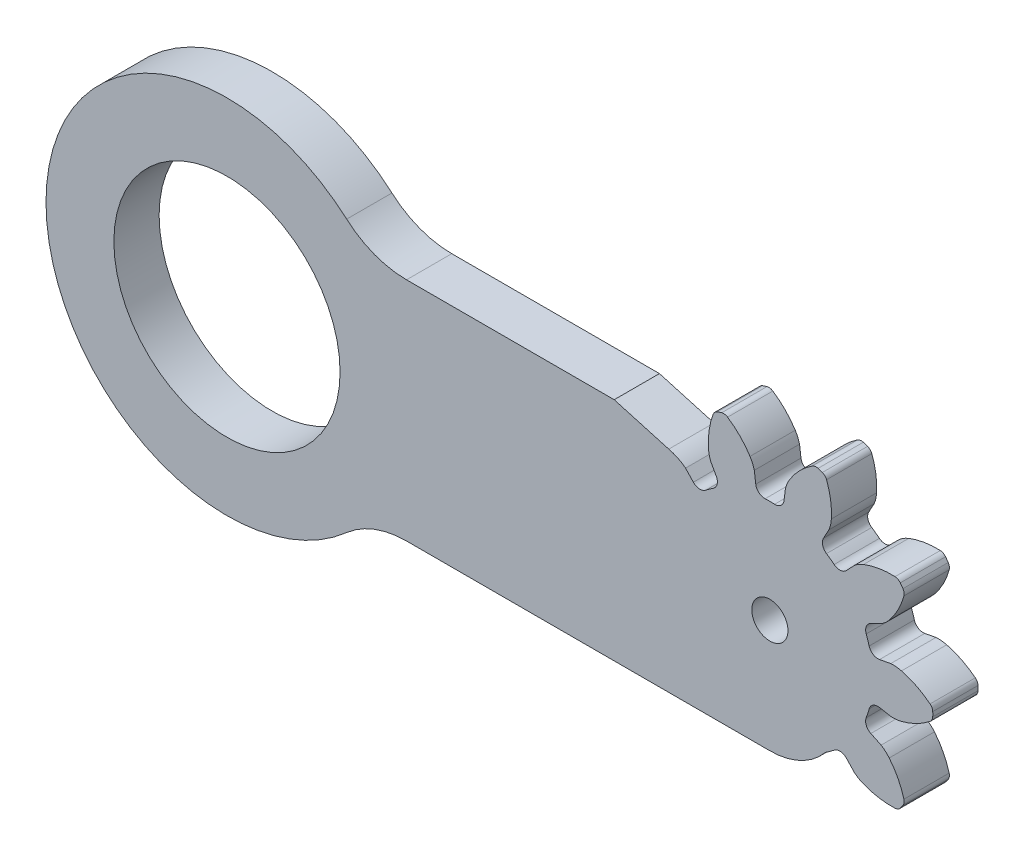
ISO-10303-21;
HEADER;
FILE_DESCRIPTION(('STEP AP214'),'2;1');
FILE_NAME('part.step','',(''),(''),'','','');
FILE_SCHEMA(('AUTOMOTIVE_DESIGN { 1 0 10303 214 1 1 1 1 }'));
ENDSEC;
DATA;
#1=APPLICATION_CONTEXT('core data for automotive mechanical design processes');
#2=APPLICATION_PROTOCOL_DEFINITION('international standard','automotive_design',2000,#1);
#3=PRODUCT_CONTEXT('',#1,'mechanical');
#4=PRODUCT('Part','Part','',(#3));
#5=PRODUCT_RELATED_PRODUCT_CATEGORY('part','',(#4));
#6=PRODUCT_DEFINITION_FORMATION('','',#4);
#7=PRODUCT_DEFINITION_CONTEXT('part definition',#1,'design');
#8=PRODUCT_DEFINITION('design','',#6,#7);
#9=PRODUCT_DEFINITION_SHAPE('','',#8);
#10=(LENGTH_UNIT() NAMED_UNIT(*) SI_UNIT(.MILLI.,.METRE.));
#11=(NAMED_UNIT(*) PLANE_ANGLE_UNIT() SI_UNIT($,.RADIAN.));
#12=(NAMED_UNIT(*) SI_UNIT($,.STERADIAN.) SOLID_ANGLE_UNIT());
#13=UNCERTAINTY_MEASURE_WITH_UNIT(LENGTH_MEASURE(1.E-05),#10,'distance_accuracy_value','');
#14=(GEOMETRIC_REPRESENTATION_CONTEXT(3) GLOBAL_UNCERTAINTY_ASSIGNED_CONTEXT((#13)) GLOBAL_UNIT_ASSIGNED_CONTEXT((#10,
#11,#12)) REPRESENTATION_CONTEXT('',''));
#15=CARTESIAN_POINT('',(0.,0.,0.));
#16=DIRECTION('',(0.,0.,1.));
#17=DIRECTION('',(1.,0.,0.));
#18=AXIS2_PLACEMENT_3D('',#15,#16,#17);
#19=CARTESIAN_POINT('',(39.6862687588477,45.0000008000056,0.));
#20=DIRECTION('',(0.,0.,1.));
#21=DIRECTION('',(1.,0.,0.));
#22=AXIS2_PLACEMENT_3D('',#19,#20,#21);
#23=CYLINDRICAL_SURFACE('',#22,20.);
#24=DIRECTION('',(0.,0.,1.));
#25=VECTOR('',#24,1.);
#26=CARTESIAN_POINT('',(26.4575125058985,30.0000005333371,0.));
#27=LINE('',#26,#25);
#28=CARTESIAN_POINT('',(26.4575125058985,30.0000005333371,10.));
#29=VERTEX_POINT('',#28);
#30=CARTESIAN_POINT('',(26.4575125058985,30.0000005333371,0.));
#31=VERTEX_POINT('',#30);
#32=EDGE_CURVE('E527',#29,#31,#27,.F.);
#33=ORIENTED_EDGE('',*,*,#32,.F.);
#34=CARTESIAN_POINT('',(39.6862687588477,45.0000008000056,10.));
#35=DIRECTION('',(0.,0.,1.));
#36=DIRECTION('',(1.,0.,0.));
#37=AXIS2_PLACEMENT_3D('',#34,#35,#36);
#38=CIRCLE('',#37,20.);
#39=CARTESIAN_POINT('',(39.6862687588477,25.0000008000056,10.));
#40=VERTEX_POINT('',#39);
#41=EDGE_CURVE('E46',#29,#40,#38,.T.);
#42=ORIENTED_EDGE('',*,*,#41,.T.);
#43=DIRECTION('',(0.,0.,1.));
#44=VECTOR('',#43,1.);
#45=CARTESIAN_POINT('',(39.6862687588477,25.0000008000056,10.));
#46=LINE('',#45,#44);
#47=CARTESIAN_POINT('',(39.6862687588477,25.0000008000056,0.));
#48=VERTEX_POINT('',#47);
#49=EDGE_CURVE('E530',#48,#40,#46,.T.);
#50=ORIENTED_EDGE('',*,*,#49,.F.);
#51=CARTESIAN_POINT('',(39.6862687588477,45.0000008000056,0.));
#52=DIRECTION('',(0.,0.,1.));
#53=DIRECTION('',(1.,0.,0.));
#54=AXIS2_PLACEMENT_3D('',#51,#52,#53);
#55=CIRCLE('',#54,20.);
#56=EDGE_CURVE('E11',#48,#31,#55,.F.);
#57=ORIENTED_EDGE('',*,*,#56,.T.);
#58=EDGE_LOOP('',(#33,#42,#50,#57));
#59=FACE_BOUND('',#58,.T.);
#60=ADVANCED_FACE('F39',(#59),#23,.F.);
#61=CARTESIAN_POINT('',(39.6862687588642,-45.0000007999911,0.));
#62=DIRECTION('',(0.,0.,1.));
#63=DIRECTION('',(1.,0.,0.));
#64=AXIS2_PLACEMENT_3D('',#61,#62,#63);
#65=CYLINDRICAL_SURFACE('',#64,20.);
#66=DIRECTION('',(0.,0.,1.));
#67=VECTOR('',#66,1.);
#68=CARTESIAN_POINT('',(26.4575125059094,-30.0000005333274,0.));
#69=LINE('',#68,#67);
#70=CARTESIAN_POINT('',(26.4575125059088,-30.000000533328,0.));
#71=VERTEX_POINT('',#70);
#72=CARTESIAN_POINT('',(26.4575125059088,-30.000000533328,10.));
#73=VERTEX_POINT('',#72);
#74=EDGE_CURVE('E511',#71,#73,#69,.T.);
#75=ORIENTED_EDGE('',*,*,#74,.F.);
#76=CARTESIAN_POINT('',(39.6862687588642,-45.0000007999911,0.));
#77=DIRECTION('',(0.,0.,1.));
#78=DIRECTION('',(1.,0.,0.));
#79=AXIS2_PLACEMENT_3D('',#76,#77,#78);
#80=CIRCLE('',#79,20.);
#81=CARTESIAN_POINT('',(39.6862687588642,-25.0000007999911,0.));
#82=VERTEX_POINT('',#81);
#83=EDGE_CURVE('E522',#71,#82,#80,.F.);
#84=ORIENTED_EDGE('',*,*,#83,.T.);
#85=DIRECTION('',(0.,0.,1.));
#86=VECTOR('',#85,1.);
#87=CARTESIAN_POINT('',(39.6862687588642,-25.0000007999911,10.));
#88=LINE('',#87,#86);
#89=CARTESIAN_POINT('',(39.6862687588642,-25.0000007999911,10.));
#90=VERTEX_POINT('',#89);
#91=EDGE_CURVE('E514',#90,#82,#88,.F.);
#92=ORIENTED_EDGE('',*,*,#91,.F.);
#93=CARTESIAN_POINT('',(39.6862687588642,-45.0000007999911,10.));
#94=DIRECTION('',(0.,0.,1.));
#95=DIRECTION('',(1.,0.,0.));
#96=AXIS2_PLACEMENT_3D('',#93,#94,#95);
#97=CIRCLE('',#96,20.);
#98=EDGE_CURVE('E524',#90,#73,#97,.T.);
#99=ORIENTED_EDGE('',*,*,#98,.T.);
#100=EDGE_LOOP('',(#75,#84,#92,#99));
#101=FACE_BOUND('',#100,.T.);
#102=ADVANCED_FACE('F1038',(#101),#65,.F.);
#103=CARTESIAN_POINT('',(104.544306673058,19.329882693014,10.));
#104=DIRECTION('',(0.,0.,1.));
#105=DIRECTION('',(1.,0.,0.));
#106=AXIS2_PLACEMENT_3D('',#103,#104,#105);
#107=PLANE('',#106);
#108=ORIENTED_EDGE('',*,*,#41,.F.);
#109=CARTESIAN_POINT('',(0.,0.,10.));
#110=DIRECTION('',(0.,0.,1.));
#111=DIRECTION('',(1.,0.,0.));
#112=AXIS2_PLACEMENT_3D('',#109,#110,#111);
#113=CIRCLE('',#112,40.);
#114=EDGE_CURVE('E1019',#29,#73,#113,.T.);
#115=ORIENTED_EDGE('',*,*,#114,.T.);
#116=ORIENTED_EDGE('',*,*,#98,.F.);
#117=DIRECTION('',(1.,0.,0.));
#118=VECTOR('',#117,1.);
#119=CARTESIAN_POINT('',(120.000003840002,-25.0000007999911,10.));
#120=LINE('',#119,#118);
#121=CARTESIAN_POINT('',(120.000003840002,-25.0000007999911,10.));
#122=VERTEX_POINT('',#121);
#123=EDGE_CURVE('E542',#90,#122,#120,.T.);
#124=ORIENTED_EDGE('',*,*,#123,.T.);
#125=CARTESIAN_POINT('',(120.000003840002,-9.20404267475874,10.));
#126=DIRECTION('',(0.,0.,1.));
#127=DIRECTION('',(1.,0.,0.));
#128=AXIS2_PLACEMENT_3D('',#125,#126,#127);
#129=CIRCLE('',#128,15.7959581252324);
#130=CARTESIAN_POINT('',(132.078435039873,-19.3836199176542,10.));
#131=VERTEX_POINT('',#130);
#132=EDGE_CURVE('E544',#122,#131,#129,.T.);
#133=ORIENTED_EDGE('',*,*,#132,.T.);
#134=CARTESIAN_POINT('',(133.607741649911,-20.6725037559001,10.));
#135=DIRECTION('',(0.,0.,-1.));
#136=DIRECTION('',(1.,0.,0.));
#137=AXIS2_PLACEMENT_3D('',#134,#135,#136);
#138=CIRCLE('',#137,2.00000006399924);
#139=CARTESIAN_POINT('',(132.508090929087,-19.0019444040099,10.));
#140=VERTEX_POINT('',#139);
#141=EDGE_CURVE('E550',#131,#140,#138,.T.);
#142=ORIENTED_EDGE('',*,*,#141,.T.);
#143=CARTESIAN_POINT('',(120.000003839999,1.23555679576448E-11,10.));
#144=DIRECTION('',(0.,0.,1.));
#145=DIRECTION('',(1.,0.,0.));
#146=AXIS2_PLACEMENT_3D('',#143,#144,#145);
#147=CIRCLE('',#146,22.7492007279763);
#148=CARTESIAN_POINT('',(134.206715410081,-17.7678214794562,10.));
#149=VERTEX_POINT('',#148);
#150=EDGE_CURVE('E552',#140,#149,#147,.T.);
#151=ORIENTED_EDGE('',*,*,#150,.T.);
#152=CARTESIAN_POINT('',(135.455701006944,-19.3298826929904,10.));
#153=DIRECTION('',(0.,0.,-1.));
#154=DIRECTION('',(1.,0.,0.));
#155=AXIS2_PLACEMENT_3D('',#152,#153,#154);
#156=CIRCLE('',#155,2.00000006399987);
#157=CARTESIAN_POINT('',(136.911101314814,-17.9580918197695,10.));
#158=VERTEX_POINT('',#157);
#159=EDGE_CURVE('E554',#149,#158,#156,.T.);
#160=ORIENTED_EDGE('',*,*,#159,.T.);
#161=DIRECTION('',(0.685895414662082,-0.727700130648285,0.));
#162=VECTOR('',#161,1.);
#163=CARTESIAN_POINT('',(138.640848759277,-19.7932658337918,10.));
#164=LINE('',#163,#162);
#165=CARTESIAN_POINT('',(138.640848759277,-19.7932658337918,10.));
#166=VERTEX_POINT('',#165);
#167=EDGE_CURVE('E556',#158,#166,#164,.T.);
#168=ORIENTED_EDGE('',*,*,#167,.T.);
#169=CARTESIAN_POINT('',(143.38709508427,-14.1265127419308,10.));
#170=DIRECTION('',(0.,0.,1.));
#171=DIRECTION('',(1.,0.,0.));
#172=AXIS2_PLACEMENT_3D('',#169,#170,#171);
#173=CIRCLE('',#172,7.39181606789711);
#174=CARTESIAN_POINT('',(140.691497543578,-21.0092955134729,10.));
#175=VERTEX_POINT('',#174);
#176=EDGE_CURVE('E558',#166,#175,#173,.T.);
#177=ORIENTED_EDGE('',*,*,#176,.T.);
#178=CARTESIAN_POINT('',(146.898476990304,-5.16075337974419,10.));
#179=DIRECTION('',(0.,0.,1.));
#180=DIRECTION('',(1.,0.,0.));
#181=AXIS2_PLACEMENT_3D('',#178,#179,#180);
#182=CIRCLE('',#181,17.020660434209);
#183=CARTESIAN_POINT('',(147.657665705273,-22.1644739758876,10.));
#184=VERTEX_POINT('',#183);
#185=EDGE_CURVE('E560',#175,#184,#182,.T.);
#186=ORIENTED_EDGE('',*,*,#185,.T.);
#187=CARTESIAN_POINT('',(147.587314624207,-20.5888049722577,10.));
#188=DIRECTION('',(0.,0.,1.));
#189=DIRECTION('',(1.,0.,0.));
#190=AXIS2_PLACEMENT_3D('',#187,#188,#189);
#191=CIRCLE('',#190,1.57723875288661);
#192=CARTESIAN_POINT('',(148.827516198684,-21.563270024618,10.));
#193=VERTEX_POINT('',#192);
#194=EDGE_CURVE('E562',#184,#193,#191,.T.);
#195=ORIENTED_EDGE('',*,*,#194,.T.);
#196=CARTESIAN_POINT('',(120.000003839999,1.23555679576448E-11,10.));
#197=DIRECTION('',(0.,0.,1.));
#198=DIRECTION('',(1.,0.,0.));
#199=AXIS2_PLACEMENT_3D('',#196,#197,#198);
#200=CIRCLE('',#199,36.0000011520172);
#201=CARTESIAN_POINT('',(149.416083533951,-20.7531765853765,10.));
#202=VERTEX_POINT('',#201);
#203=EDGE_CURVE('E564',#193,#202,#200,.T.);
#204=ORIENTED_EDGE('',*,*,#203,.T.);
#205=CARTESIAN_POINT('',(148.106068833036,-19.8748010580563,10.));
#206=DIRECTION('',(0.,0.,1.));
#207=DIRECTION('',(1.,0.,0.));
#208=AXIS2_PLACEMENT_3D('',#205,#206,#207);
#209=CIRCLE('',#208,1.57723875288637);
#210=CARTESIAN_POINT('',(149.626358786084,-19.4548004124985,10.));
#211=VERTEX_POINT('',#210);
#212=EDGE_CURVE('E566',#202,#211,#209,.T.);
#213=ORIENTED_EDGE('',*,*,#212,.T.);
#214=CARTESIAN_POINT('',(133.220257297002,-23.9872076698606,10.));
#215=DIRECTION('',(0.,0.,1.));
#216=DIRECTION('',(1.,0.,0.));
#217=AXIS2_PLACEMENT_3D('',#214,#215,#216);
#218=CIRCLE('',#217,17.0206604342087);
#219=CARTESIAN_POINT('',(146.375054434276,-13.186550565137,10.));
#220=VERTEX_POINT('',#219);
#221=EDGE_CURVE('E568',#211,#220,#218,.T.);
#222=ORIENTED_EDGE('',*,*,#221,.T.);
#223=CARTESIAN_POINT('',(140.662124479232,-17.8771130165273,10.));
#224=DIRECTION('',(0.,0.,1.));
#225=DIRECTION('',(1.,0.,0.));
#226=AXIS2_PLACEMENT_3D('',#223,#224,#225);
#227=CIRCLE('',#226,7.39181606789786);
#228=CARTESIAN_POINT('',(144.584856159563,-11.6120415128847,10.));
#229=VERTEX_POINT('',#228);
#230=EDGE_CURVE('E570',#220,#229,#227,.T.);
#231=ORIENTED_EDGE('',*,*,#230,.T.);
#232=DIRECTION('',(-0.904037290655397,0.427453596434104,0.));
#233=VECTOR('',#232,1.);
#234=CARTESIAN_POINT('',(142.304980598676,-10.5340538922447,10.));
#235=LINE('',#234,#233);
#236=CARTESIAN_POINT('',(142.304980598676,-10.5340538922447,10.));
#237=VERTEX_POINT('',#236);
#238=EDGE_CURVE('E572',#229,#237,#235,.T.);
#239=ORIENTED_EDGE('',*,*,#238,.T.);
#240=CARTESIAN_POINT('',(143.159887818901,-8.72597925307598,10.));
#241=DIRECTION('',(0.,0.,-1.));
#242=DIRECTION('',(1.,0.,0.));
#243=AXIS2_PLACEMENT_3D('',#240,#241,#242);
#244=CIRCLE('',#243,2.00000006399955);
#245=CARTESIAN_POINT('',(141.288321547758,-8.02082682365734,10.));
#246=VERTEX_POINT('',#245);
#247=EDGE_CURVE('E574',#237,#246,#244,.T.);
#248=ORIENTED_EDGE('',*,*,#247,.T.);
#249=CARTESIAN_POINT('',(120.000003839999,1.23555679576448E-11,10.));
#250=DIRECTION('',(0.,0.,1.));
#251=DIRECTION('',(1.,0.,0.));
#252=AXIS2_PLACEMENT_3D('',#249,#250,#251);
#253=CIRCLE('',#252,22.7492007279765);
#254=CARTESIAN_POINT('',(141.937138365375,-6.02397398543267,10.));
#255=VERTEX_POINT('',#254);
#256=EDGE_CURVE('E576',#246,#255,#253,.T.);
#257=ORIENTED_EDGE('',*,*,#256,.T.);
#258=CARTESIAN_POINT('',(143.865745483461,-6.55357273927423,10.));
#259=DIRECTION('',(0.,0.,-1.));
#260=DIRECTION('',(1.,0.,0.));
#261=AXIS2_PLACEMENT_3D('',#258,#259,#260);
#262=CIRCLE('',#261,2.00000006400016);
#263=CARTESIAN_POINT('',(144.236870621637,-4.58830777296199,10.));
#264=VERTEX_POINT('',#263);
#265=EDGE_CURVE('E578',#255,#264,#262,.T.);
#266=ORIENTED_EDGE('',*,*,#265,.T.);
#267=DIRECTION('',(0.982632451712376,-0.185562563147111,0.));
#268=VECTOR('',#267,1.);
#269=CARTESIAN_POINT('',(146.714953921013,-5.05627469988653,10.));
#270=LINE('',#269,#268);
#271=CARTESIAN_POINT('',(146.714953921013,-5.05627469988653,10.));
#272=VERTEX_POINT('',#271);
#273=EDGE_CURVE('E580',#264,#272,#270,.T.);
#274=ORIENTED_EDGE('',*,*,#273,.T.);
#275=CARTESIAN_POINT('',(147.223913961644,2.31799844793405,10.));
#276=DIRECTION('',(0.,0.,1.));
#277=DIRECTION('',(1.,0.,0.));
#278=AXIS2_PLACEMENT_3D('',#275,#276,#277);
#279=CIRCLE('',#278,7.39181606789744);
#280=CARTESIAN_POINT('',(149.088727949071,-4.8347222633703,10.));
#281=VERTEX_POINT('',#280);
#282=EDGE_CURVE('E582',#272,#281,#279,.T.);
#283=ORIENTED_EDGE('',*,*,#282,.T.);
#284=CARTESIAN_POINT('',(144.794740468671,11.6353886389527,10.));
#285=DIRECTION('',(0.,0.,1.));
#286=DIRECTION('',(1.,0.,0.));
#287=AXIS2_PLACEMENT_3D('',#284,#285,#286);
#288=CIRCLE('',#287,17.0206604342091);
#289=CARTESIAN_POINT('',(155.40347324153,-1.67467036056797,10.));
#290=VERTEX_POINT('',#289);
#291=EDGE_CURVE('E584',#281,#290,#288,.T.);
#292=ORIENTED_EDGE('',*,*,#291,.T.);
#293=CARTESIAN_POINT('',(154.420403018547,-0.441278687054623,10.));
#294=DIRECTION('',(0.,0.,1.));
#295=DIRECTION('',(1.,0.,0.));
#296=AXIS2_PLACEMENT_3D('',#293,#294,#295);
#297=CIRCLE('',#296,1.57723875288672);
#298=CARTESIAN_POINT('',(155.996523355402,-0.50066527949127,10.));
#299=VERTEX_POINT('',#298);
#300=EDGE_CURVE('E586',#290,#299,#297,.T.);
#301=ORIENTED_EDGE('',*,*,#300,.T.);
#302=CARTESIAN_POINT('',(120.000003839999,1.23555679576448E-11,10.));
#303=DIRECTION('',(0.,0.,1.));
#304=DIRECTION('',(1.,0.,0.));
#305=AXIS2_PLACEMENT_3D('',#302,#303,#304);
#306=CIRCLE('',#305,36.0000011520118);
#307=CARTESIAN_POINT('',(155.996523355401,0.500665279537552,10.));
#308=VERTEX_POINT('',#307);
#309=EDGE_CURVE('E588',#299,#308,#306,.T.);
#310=ORIENTED_EDGE('',*,*,#309,.T.);
#311=CARTESIAN_POINT('',(154.420403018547,0.441278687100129,10.));
#312=DIRECTION('',(0.,0.,1.));
#313=DIRECTION('',(1.,0.,0.));
#314=AXIS2_PLACEMENT_3D('',#311,#312,#313);
#315=CIRCLE('',#314,1.57723875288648);
#316=CARTESIAN_POINT('',(155.403473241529,1.67467036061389,10.));
#317=VERTEX_POINT('',#316);
#318=EDGE_CURVE('E590',#308,#317,#315,.T.);
#319=ORIENTED_EDGE('',*,*,#318,.T.);
#320=CARTESIAN_POINT('',(144.794740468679,-11.6353886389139,10.));
#321=DIRECTION('',(0.,0.,1.));
#322=DIRECTION('',(1.,0.,0.));
#323=AXIS2_PLACEMENT_3D('',#320,#321,#322);
#324=CIRCLE('',#323,17.0206604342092);
#325=CARTESIAN_POINT('',(149.088727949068,4.83472226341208,10.));
#326=VERTEX_POINT('',#325);
#327=EDGE_CURVE('E592',#317,#326,#324,.T.);
#328=ORIENTED_EDGE('',*,*,#327,.T.);
#329=CARTESIAN_POINT('',(147.223913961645,-2.31799844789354,10.));
#330=DIRECTION('',(0.,0.,1.));
#331=DIRECTION('',(1.,0.,0.));
#332=AXIS2_PLACEMENT_3D('',#329,#330,#331);
#333=CIRCLE('',#332,7.39181606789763);
#334=CARTESIAN_POINT('',(146.71495392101,5.05627469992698,10.));
#335=VERTEX_POINT('',#334);
#336=EDGE_CURVE('E594',#326,#335,#333,.T.);
#337=ORIENTED_EDGE('',*,*,#336,.T.);
#338=DIRECTION('',(-0.982632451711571,-0.185562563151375,0.));
#339=VECTOR('',#338,1.);
#340=CARTESIAN_POINT('',(144.236870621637,4.58830777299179,10.));
#341=LINE('',#340,#339);
#342=CARTESIAN_POINT('',(144.236870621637,4.58830777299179,10.));
#343=VERTEX_POINT('',#342);
#344=EDGE_CURVE('E596',#335,#343,#341,.T.);
#345=ORIENTED_EDGE('',*,*,#344,.T.);
#346=CARTESIAN_POINT('',(143.865745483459,6.5535727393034,10.));
#347=DIRECTION('',(0.,0.,-1.));
#348=DIRECTION('',(1.,0.,0.));
#349=AXIS2_PLACEMENT_3D('',#346,#347,#348);
#350=CIRCLE('',#349,2.00000006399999);
#351=CARTESIAN_POINT('',(141.937138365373,6.02397398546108,10.));
#352=VERTEX_POINT('',#351);
#353=EDGE_CURVE('E598',#343,#352,#350,.T.);
#354=ORIENTED_EDGE('',*,*,#353,.T.);
#355=CARTESIAN_POINT('',(120.000003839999,1.23555679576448E-11,10.));
#356=DIRECTION('',(0.,0.,1.));
#357=DIRECTION('',(1.,0.,0.));
#358=AXIS2_PLACEMENT_3D('',#355,#356,#357);
#359=CIRCLE('',#358,22.7492007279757);
#360=CARTESIAN_POINT('',(141.288321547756,8.02082682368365,10.));
#361=VERTEX_POINT('',#360);
#362=EDGE_CURVE('E600',#352,#361,#359,.T.);
#363=ORIENTED_EDGE('',*,*,#362,.T.);
#364=CARTESIAN_POINT('',(143.1598878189,8.72597925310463,10.));
#365=DIRECTION('',(0.,0.,-1.));
#366=DIRECTION('',(1.,0.,0.));
#367=AXIS2_PLACEMENT_3D('',#364,#365,#366);
#368=CIRCLE('',#367,2.00000006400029);
#369=CARTESIAN_POINT('',(142.304980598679,10.534053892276,10.));
#370=VERTEX_POINT('',#369);
#371=EDGE_CURVE('E602',#361,#370,#368,.T.);
#372=ORIENTED_EDGE('',*,*,#371,.T.);
#373=DIRECTION('',(0.904037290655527,0.427453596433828,0.));
#374=VECTOR('',#373,1.);
#375=CARTESIAN_POINT('',(144.58485615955,11.6120415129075,10.));
#376=LINE('',#375,#374);
#377=CARTESIAN_POINT('',(144.58485615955,11.6120415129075,10.));
#378=VERTEX_POINT('',#377);
#379=EDGE_CURVE('E604',#370,#378,#376,.T.);
#380=ORIENTED_EDGE('',*,*,#379,.T.);
#381=CARTESIAN_POINT('',(140.662124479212,17.8771130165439,10.));
#382=DIRECTION('',(0.,0.,1.));
#383=DIRECTION('',(1.,0.,0.));
#384=AXIS2_PLACEMENT_3D('',#381,#382,#383);
#385=CIRCLE('',#384,7.39181606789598);
#386=CARTESIAN_POINT('',(146.375054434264,13.1865505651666,10.));
#387=VERTEX_POINT('',#386);
#388=EDGE_CURVE('E606',#378,#387,#385,.T.);
#389=ORIENTED_EDGE('',*,*,#388,.T.);
#390=CARTESIAN_POINT('',(133.220257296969,23.9872076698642,10.));
#391=DIRECTION('',(0.,0.,1.));
#392=DIRECTION('',(1.,0.,0.));
#393=AXIS2_PLACEMENT_3D('',#390,#391,#392);
#394=CIRCLE('',#393,17.0206604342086);
#395=CARTESIAN_POINT('',(149.62635878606,19.4548004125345,10.));
#396=VERTEX_POINT('',#395);
#397=EDGE_CURVE('E608',#387,#396,#394,.T.);
#398=ORIENTED_EDGE('',*,*,#397,.T.);
#399=CARTESIAN_POINT('',(148.106068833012,19.8748010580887,10.));
#400=DIRECTION('',(0.,0.,1.));
#401=DIRECTION('',(1.,0.,0.));
#402=AXIS2_PLACEMENT_3D('',#399,#400,#401);
#403=CIRCLE('',#402,1.57723875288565);
#404=CARTESIAN_POINT('',(149.416083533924,20.7531765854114,10.));
#405=VERTEX_POINT('',#404);
#406=EDGE_CURVE('E610',#396,#405,#403,.T.);
#407=ORIENTED_EDGE('',*,*,#406,.T.);
#408=CARTESIAN_POINT('',(120.000003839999,1.23555679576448E-11,10.));
#409=DIRECTION('',(0.,0.,1.));
#410=DIRECTION('',(1.,0.,0.));
#411=AXIS2_PLACEMENT_3D('',#408,#409,#410);
#412=CIRCLE('',#411,36.000001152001);
#413=CARTESIAN_POINT('',(148.827516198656,21.5632700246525,10.));
#414=VERTEX_POINT('',#413);
#415=EDGE_CURVE('E612',#405,#414,#412,.T.);
#416=ORIENTED_EDGE('',*,*,#415,.T.);
#417=CARTESIAN_POINT('',(147.587314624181,20.5888049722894,10.));
#418=DIRECTION('',(0.,0.,1.));
#419=DIRECTION('',(1.,0.,0.));
#420=AXIS2_PLACEMENT_3D('',#417,#418,#419);
#421=CIRCLE('',#420,1.57723875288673);
#422=CARTESIAN_POINT('',(147.657665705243,22.1644739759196,10.));
#423=VERTEX_POINT('',#422);
#424=EDGE_CURVE('E614',#414,#423,#421,.T.);
#425=ORIENTED_EDGE('',*,*,#424,.T.);
#426=CARTESIAN_POINT('',(146.898476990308,5.16075337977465,10.));
#427=DIRECTION('',(0.,0.,1.));
#428=DIRECTION('',(1.,0.,0.));
#429=AXIS2_PLACEMENT_3D('',#426,#427,#428);
#430=CIRCLE('',#429,17.020660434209);
#431=CARTESIAN_POINT('',(140.691497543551,21.0092955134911,10.));
#432=VERTEX_POINT('',#431);
#433=EDGE_CURVE('E616',#423,#432,#430,.T.);
#434=ORIENTED_EDGE('',*,*,#433,.T.);
#435=CARTESIAN_POINT('',(143.387095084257,14.1265127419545,10.));
#436=DIRECTION('',(0.,0.,1.));
#437=DIRECTION('',(1.,0.,0.));
#438=AXIS2_PLACEMENT_3D('',#435,#436,#437);
#439=CIRCLE('',#438,7.39181606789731);
#440=CARTESIAN_POINT('',(138.640848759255,19.7932658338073,10.));
#441=VERTEX_POINT('',#440);
#442=EDGE_CURVE('E618',#432,#441,#439,.T.);
#443=ORIENTED_EDGE('',*,*,#442,.T.);
#444=DIRECTION('',(-0.685895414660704,-0.727700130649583,0.));
#445=VECTOR('',#444,1.);
#446=CARTESIAN_POINT('',(136.91110131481,17.9580918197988,10.));
#447=LINE('',#446,#445);
#448=CARTESIAN_POINT('',(136.91110131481,17.9580918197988,10.));
#449=VERTEX_POINT('',#448);
#450=EDGE_CURVE('E620',#441,#449,#447,.T.);
#451=ORIENTED_EDGE('',*,*,#450,.T.);
#452=CARTESIAN_POINT('',(135.455701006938,19.3298826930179,10.));
#453=DIRECTION('',(0.,0.,-1.));
#454=DIRECTION('',(1.,0.,0.));
#455=AXIS2_PLACEMENT_3D('',#452,#453,#454);
#456=CIRCLE('',#455,2.0000000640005);
#457=CARTESIAN_POINT('',(134.206715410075,17.7678214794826,10.));
#458=VERTEX_POINT('',#457);
#459=EDGE_CURVE('E622',#449,#458,#456,.T.);
#460=ORIENTED_EDGE('',*,*,#459,.T.);
#461=CARTESIAN_POINT('',(120.000003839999,1.23555679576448E-11,10.));
#462=DIRECTION('',(0.,0.,1.));
#463=DIRECTION('',(1.,0.,0.));
#464=AXIS2_PLACEMENT_3D('',#461,#462,#463);
#465=CIRCLE('',#464,22.7492007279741);
#466=CARTESIAN_POINT('',(132.50809092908,19.0019444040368,10.));
#467=VERTEX_POINT('',#466);
#468=EDGE_CURVE('E624',#458,#467,#465,.T.);
#469=ORIENTED_EDGE('',*,*,#468,.T.);
#470=CARTESIAN_POINT('',(133.607741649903,20.6725037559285,10.));
#471=DIRECTION('',(0.,0.,-1.));
#472=DIRECTION('',(1.,0.,0.));
#473=AXIS2_PLACEMENT_3D('',#470,#471,#472);
#474=CIRCLE('',#473,2.0000000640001);
#475=CARTESIAN_POINT('',(131.853347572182,21.6327650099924,10.));
#476=VERTEX_POINT('',#475);
#477=EDGE_CURVE('E626',#467,#476,#474,.T.);
#478=ORIENTED_EDGE('',*,*,#477,.T.);
#479=DIRECTION('',(0.48013061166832,0.877197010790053,0.));
#480=VECTOR('',#479,1.);
#481=CARTESIAN_POINT('',(133.06418042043,23.8449525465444,10.));
#482=LINE('',#481,#480);
#483=CARTESIAN_POINT('',(133.06418042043,23.8449525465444,10.));
#484=VERTEX_POINT('',#483);
#485=EDGE_CURVE('E628',#476,#484,#482,.T.);
#486=ORIENTED_EDGE('',*,*,#485,.T.);
#487=CARTESIAN_POINT('',(126.208107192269,26.6077780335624,10.));
#488=DIRECTION('',(0.,0.,1.));
#489=DIRECTION('',(1.,0.,0.));
#490=AXIS2_PLACEMENT_3D('',#487,#488,#489);
#491=CIRCLE('',#490,7.39181606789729);
#492=CARTESIAN_POINT('',(133.587008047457,26.1710092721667,10.));
#493=VERTEX_POINT('',#492);
#494=EDGE_CURVE('E630',#484,#493,#491,.T.);
#495=ORIENTED_EDGE('',*,*,#494,.T.);
#496=CARTESIAN_POINT('',(116.596086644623,27.1767286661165,10.));
#497=DIRECTION('',(0.,0.,1.));
#498=DIRECTION('',(1.,0.,0.));
#499=AXIS2_PLACEMENT_3D('',#496,#497,#498);
#500=CIRCLE('',#499,17.0206604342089);
#501=CARTESIAN_POINT('',(132.532983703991,33.1531986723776,10.));
#502=VERTEX_POINT('',#501);
#503=EDGE_CURVE('E632',#493,#502,#500,.T.);
#504=ORIENTED_EDGE('',*,*,#503,.T.);
#505=CARTESIAN_POINT('',(131.056173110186,32.5993823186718,10.));
#506=DIRECTION('',(0.,0.,1.));
#507=DIRECTION('',(1.,0.,0.));
#508=AXIS2_PLACEMENT_3D('',#505,#506,#507);
#509=CIRCLE('',#508,1.57723875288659);
#510=CARTESIAN_POINT('',(131.599701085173,34.080010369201,10.));
#511=VERTEX_POINT('',#510);
#512=EDGE_CURVE('E634',#502,#511,#509,.T.);
#513=ORIENTED_EDGE('',*,*,#512,.T.);
#514=CARTESIAN_POINT('',(120.000003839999,1.23555679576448E-11,10.));
#515=DIRECTION('',(0.,0.,1.));
#516=DIRECTION('',(1.,0.,0.));
#517=AXIS2_PLACEMENT_3D('',#514,#515,#516);
#518=CIRCLE('',#517,36.0000011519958);
#519=CARTESIAN_POINT('',(130.647379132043,34.389438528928,10.));
#520=VERTEX_POINT('',#519);
#521=EDGE_CURVE('E636',#511,#520,#518,.T.);
#522=ORIENTED_EDGE('',*,*,#521,.T.);
#523=CARTESIAN_POINT('',(130.216811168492,32.8721075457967,10.));
#524=DIRECTION('',(0.,0.,1.));
#525=DIRECTION('',(1.,0.,0.));
#526=AXIS2_PLACEMENT_3D('',#523,#524,#525);
#527=CIRCLE('',#526,1.57723875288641);
#528=CARTESIAN_POINT('',(129.347571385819,34.1882018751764,10.));
#529=VERTEX_POINT('',#528);
#530=EDGE_CURVE('E638',#520,#529,#527,.T.);
#531=ORIENTED_EDGE('',*,*,#530,.T.);
#532=CARTESIAN_POINT('',(138.727911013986,19.9856630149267,10.));
#533=DIRECTION('',(0.,0.,1.));
#534=DIRECTION('',(1.,0.,0.));
#535=AXIS2_PLACEMENT_3D('',#532,#533,#534);
#536=CIRCLE('',#535,17.0206604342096);
#537=CARTESIAN_POINT('',(124.390819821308,29.1590319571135,10.));
#538=VERTEX_POINT('',#537);
#539=EDGE_CURVE('E640',#529,#538,#536,.T.);
#540=ORIENTED_EDGE('',*,*,#539,.T.);
#541=CARTESIAN_POINT('',(130.617202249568,25.1751762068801,10.));
#542=DIRECTION('',(0.,0.,1.));
#543=DIRECTION('',(1.,0.,0.));
#544=AXIS2_PLACEMENT_3D('',#541,#542,#543);
#545=CIRCLE('',#544,7.39181606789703);
#546=CARTESIAN_POINT('',(123.446574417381,26.9699021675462,10.));
#547=VERTEX_POINT('',#546);
#548=EDGE_CURVE('E642',#538,#547,#545,.T.);
#549=ORIENTED_EDGE('',*,*,#548,.T.);
#550=DIRECTION('',(-0.127169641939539,-0.991880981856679,0.));
#551=VECTOR('',#550,1.);
#552=CARTESIAN_POINT('',(123.125867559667,24.4684951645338,10.));
#553=LINE('',#552,#551);
#554=CARTESIAN_POINT('',(123.125867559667,24.4684951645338,10.));
#555=VERTEX_POINT('',#554);
#556=EDGE_CURVE('E644',#547,#555,#553,.T.);
#557=ORIENTED_EDGE('',*,*,#556,.T.);
#558=CARTESIAN_POINT('',(121.142105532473,24.7228344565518,10.));
#559=DIRECTION('',(0.,0.,-1.));
#560=DIRECTION('',(1.,0.,0.));
#561=AXIS2_PLACEMENT_3D('',#558,#559,#560);
#562=CIRCLE('',#561,2.0000000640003);
#563=CARTESIAN_POINT('',(121.049811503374,22.7249650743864,10.));
#564=VERTEX_POINT('',#563);
#565=EDGE_CURVE('E646',#555,#564,#562,.T.);
#566=ORIENTED_EDGE('',*,*,#565,.T.);
#567=CARTESIAN_POINT('',(120.000003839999,1.23555679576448E-11,10.));
#568=DIRECTION('',(0.,0.,1.));
#569=DIRECTION('',(1.,0.,0.));
#570=AXIS2_PLACEMENT_3D('',#567,#568,#569);
#571=CIRCLE('',#570,22.7492007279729);
#572=CARTESIAN_POINT('',(118.95019617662,22.7249650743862,10.));
#573=VERTEX_POINT('',#572);
#574=EDGE_CURVE('E648',#564,#573,#571,.T.);
#575=ORIENTED_EDGE('',*,*,#574,.T.);
#576=CARTESIAN_POINT('',(118.857902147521,24.7228344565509,10.));
#577=DIRECTION('',(0.,0.,-1.));
#578=DIRECTION('',(1.,0.,0.));
#579=AXIS2_PLACEMENT_3D('',#576,#577,#578);
#580=CIRCLE('',#579,2.00000006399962);
#581=CARTESIAN_POINT('',(116.874140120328,24.4684951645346,10.));
#582=VERTEX_POINT('',#581);
#583=EDGE_CURVE('E650',#573,#582,#580,.T.);
#584=ORIENTED_EDGE('',*,*,#583,.T.);
#585=DIRECTION('',(-0.127169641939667,0.991880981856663,0.));
#586=VECTOR('',#585,1.);
#587=CARTESIAN_POINT('',(116.553433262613,26.9699021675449,10.));
#588=LINE('',#587,#586);
#589=CARTESIAN_POINT('',(116.553433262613,26.9699021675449,10.));
#590=VERTEX_POINT('',#589);
#591=EDGE_CURVE('E652',#582,#590,#588,.T.);
#592=ORIENTED_EDGE('',*,*,#591,.T.);
#593=CARTESIAN_POINT('',(109.382805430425,25.1751762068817,10.));
#594=DIRECTION('',(0.,0.,1.));
#595=DIRECTION('',(1.,0.,0.));
#596=AXIS2_PLACEMENT_3D('',#593,#594,#595);
#597=CIRCLE('',#596,7.39181606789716);
#598=CARTESIAN_POINT('',(115.609187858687,29.1590319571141,10.));
#599=VERTEX_POINT('',#598);
#600=EDGE_CURVE('E654',#590,#599,#597,.T.);
#601=ORIENTED_EDGE('',*,*,#600,.T.);
#602=CARTESIAN_POINT('',(101.272096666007,19.9856630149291,10.));
#603=DIRECTION('',(0.,0.,1.));
#604=DIRECTION('',(1.,0.,0.));
#605=AXIS2_PLACEMENT_3D('',#602,#603,#604);
#606=CIRCLE('',#605,17.0206604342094);
#607=CARTESIAN_POINT('',(110.652436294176,34.1882018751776,10.));
#608=VERTEX_POINT('',#607);
#609=EDGE_CURVE('E656',#599,#608,#606,.T.);
#610=ORIENTED_EDGE('',*,*,#609,.T.);
#611=CARTESIAN_POINT('',(109.783196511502,32.8721075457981,10.));
#612=DIRECTION('',(0.,0.,1.));
#613=DIRECTION('',(1.,0.,0.));
#614=AXIS2_PLACEMENT_3D('',#611,#612,#613);
#615=CIRCLE('',#614,1.57723875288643);
#616=CARTESIAN_POINT('',(109.352628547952,34.3894385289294,10.));
#617=VERTEX_POINT('',#616);
#618=EDGE_CURVE('E658',#608,#617,#615,.T.);
#619=ORIENTED_EDGE('',*,*,#618,.T.);
#620=CARTESIAN_POINT('',(120.000003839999,1.23555679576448E-11,10.));
#621=DIRECTION('',(0.,0.,1.));
#622=DIRECTION('',(1.,0.,0.));
#623=AXIS2_PLACEMENT_3D('',#620,#621,#622);
#624=CIRCLE('',#623,36.0000011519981);
#625=CARTESIAN_POINT('',(108.400306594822,34.0800103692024,10.));
#626=VERTEX_POINT('',#625);
#627=EDGE_CURVE('E660',#617,#626,#624,.T.);
#628=ORIENTED_EDGE('',*,*,#627,.T.);
#629=CARTESIAN_POINT('',(108.943834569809,32.599382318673,10.));
#630=DIRECTION('',(0.,0.,1.));
#631=DIRECTION('',(1.,0.,0.));
#632=AXIS2_PLACEMENT_3D('',#629,#630,#631);
#633=CIRCLE('',#632,1.57723875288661);
#634=CARTESIAN_POINT('',(107.467023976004,33.1531986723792,10.));
#635=VERTEX_POINT('',#634);
#636=EDGE_CURVE('E662',#626,#635,#633,.T.);
#637=ORIENTED_EDGE('',*,*,#636,.T.);
#638=CARTESIAN_POINT('',(123.403921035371,27.1767286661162,10.));
#639=DIRECTION('',(0.,0.,1.));
#640=DIRECTION('',(1.,0.,0.));
#641=AXIS2_PLACEMENT_3D('',#638,#639,#640);
#642=CIRCLE('',#641,17.0206604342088);
#643=CARTESIAN_POINT('',(106.412999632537,26.1710092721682,10.));
#644=VERTEX_POINT('',#643);
#645=EDGE_CURVE('E664',#635,#644,#642,.T.);
#646=ORIENTED_EDGE('',*,*,#645,.T.);
#647=CARTESIAN_POINT('',(113.791900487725,26.6077780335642,10.));
#648=DIRECTION('',(0.,0.,1.));
#649=DIRECTION('',(1.,0.,0.));
#650=AXIS2_PLACEMENT_3D('',#647,#648,#649);
#651=CIRCLE('',#650,7.3918160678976);
#652=CARTESIAN_POINT('',(106.935827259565,23.8449525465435,10.));
#653=VERTEX_POINT('',#652);
#654=EDGE_CURVE('E666',#644,#653,#651,.T.);
#655=ORIENTED_EDGE('',*,*,#654,.T.);
#656=DIRECTION('',(0.480130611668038,-0.877197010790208,0.));
#657=VECTOR('',#656,1.);
#658=CARTESIAN_POINT('',(108.146660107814,21.632765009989,10.));
#659=LINE('',#658,#657);
#660=CARTESIAN_POINT('',(108.146660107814,21.632765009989,10.));
#661=VERTEX_POINT('',#660);
#662=EDGE_CURVE('E668',#653,#661,#659,.T.);
#663=ORIENTED_EDGE('',*,*,#662,.T.);
#664=CARTESIAN_POINT('',(106.392266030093,20.6725037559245,10.));
#665=DIRECTION('',(0.,0.,-1.));
#666=DIRECTION('',(1.,0.,0.));
#667=AXIS2_PLACEMENT_3D('',#664,#665,#666);
#668=CIRCLE('',#667,2.00000006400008);
#669=CARTESIAN_POINT('',(107.491916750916,19.0019444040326,10.));
#670=VERTEX_POINT('',#669);
#671=EDGE_CURVE('E670',#661,#670,#668,.T.);
#672=ORIENTED_EDGE('',*,*,#671,.T.);
#673=CARTESIAN_POINT('',(120.000003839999,1.23555679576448E-11,10.));
#674=DIRECTION('',(0.,0.,1.));
#675=DIRECTION('',(1.,0.,0.));
#676=AXIS2_PLACEMENT_3D('',#673,#674,#675);
#677=CIRCLE('',#676,22.7492007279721);
#678=CARTESIAN_POINT('',(105.793292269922,17.7678214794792,10.));
#679=VERTEX_POINT('',#678);
#680=EDGE_CURVE('E502',#670,#679,#677,.T.);
#681=ORIENTED_EDGE('',*,*,#680,.T.);
#682=CARTESIAN_POINT('',(104.544306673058,19.329882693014,10.));
#683=DIRECTION('',(0.,0.,-1.));
#684=DIRECTION('',(1.,0.,0.));
#685=AXIS2_PLACEMENT_3D('',#682,#683,#684);
#686=CIRCLE('',#685,2.00000006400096);
#687=CARTESIAN_POINT('',(103.088906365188,17.9580918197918,10.));
#688=VERTEX_POINT('',#687);
#689=EDGE_CURVE('E496',#679,#688,#686,.T.);
#690=ORIENTED_EDGE('',*,*,#689,.T.);
#691=DIRECTION('',(-0.685895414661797,0.727700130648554,0.));
#692=VECTOR('',#691,1.);
#693=CARTESIAN_POINT('',(101.359158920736,19.7932658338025,10.));
#694=LINE('',#693,#692);
#695=CARTESIAN_POINT('',(101.359158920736,19.7932658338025,10.));
#696=VERTEX_POINT('',#695);
#697=EDGE_CURVE('E485',#688,#696,#694,.T.);
#698=ORIENTED_EDGE('',*,*,#697,.T.);
#699=CARTESIAN_POINT('',(95.439545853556,12.2003730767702,10.));
#700=DIRECTION('',(0.,0.,1.));
#701=DIRECTION('',(1.,0.,0.));
#702=AXIS2_PLACEMENT_3D('',#699,#700,#701);
#703=CIRCLE('',#702,9.62776398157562);
#704=CARTESIAN_POINT('',(97.6480852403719,21.5714025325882,10.));
#705=VERTEX_POINT('',#704);
#706=EDGE_CURVE('E495',#696,#705,#703,.T.);
#707=ORIENTED_EDGE('',*,*,#706,.T.);
#708=DIRECTION('',(-0.961869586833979,0.273508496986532,0.));
#709=VECTOR('',#708,1.);
#710=CARTESIAN_POINT('',(85.5904547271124,25.0000008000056,10.));
#711=LINE('',#710,#709);
#712=CARTESIAN_POINT('',(85.5904547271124,25.0000008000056,10.));
#713=VERTEX_POINT('',#712);
#714=EDGE_CURVE('E540',#705,#713,#711,.T.);
#715=ORIENTED_EDGE('',*,*,#714,.T.);
#716=DIRECTION('',(-1.,0.,0.));
#717=VECTOR('',#716,1.);
#718=CARTESIAN_POINT('',(39.560872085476,25.0000008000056,10.));
#719=LINE('',#718,#717);
#720=EDGE_CURVE('E537',#713,#40,#719,.T.);
#721=ORIENTED_EDGE('',*,*,#720,.T.);
#722=EDGE_LOOP('',(#108,#115,#116,#124,#133,#142,#151,#160,#168,#177,#186,#195,#204,#213,#222,
#231,#239,#248,#257,#266,#274,#283,#292,#301,#310,#319,#328,#337,#345,#354,#363,#372,#380,#389,
#398,#407,#416,#425,#434,#443,#451,#460,#469,#478,#486,#495,#504,#513,#522,#531,#540,#549,#557,
#566,#575,#584,#592,#601,#610,#619,#628,#637,#646,#655,#663,#672,#681,#690,#698,#707,#715,#721));
#723=FACE_BOUND('',#722,.T.);
#724=CARTESIAN_POINT('',(0.,0.,10.));
#725=DIRECTION('',(0.,0.,1.));
#726=DIRECTION('',(1.,0.,0.));
#727=AXIS2_PLACEMENT_3D('',#724,#725,#726);
#728=CIRCLE('',#727,25.);
#729=CARTESIAN_POINT('',(25.,0.,10.));
#730=VERTEX_POINT('',#729);
#731=EDGE_CURVE('E1023',#730,#730,#728,.T.);
#732=ORIENTED_EDGE('',*,*,#731,.F.);
#733=EDGE_LOOP('',(#732));
#734=FACE_BOUND('',#733,.T.);
#735=CARTESIAN_POINT('',(120.000003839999,1.23555679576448E-11,10.));
#736=DIRECTION('',(0.,0.,1.));
#737=DIRECTION('',(1.,0.,0.));
#738=AXIS2_PLACEMENT_3D('',#735,#736,#737);
#739=CIRCLE('',#738,4.00000012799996);
#740=CARTESIAN_POINT('',(124.000003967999,1.23555679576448E-11,10.));
#741=VERTEX_POINT('',#740);
#742=EDGE_CURVE('E676',#741,#741,#739,.T.);
#743=ORIENTED_EDGE('',*,*,#742,.F.);
#744=EDGE_LOOP('',(#743));
#745=FACE_BOUND('',#744,.T.);
#746=ADVANCED_FACE('F499',(#723,#734,#745),#107,.T.);
#747=CARTESIAN_POINT('',(104.544306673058,19.329882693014,0.));
#748=DIRECTION('',(0.,0.,1.));
#749=DIRECTION('',(1.,0.,0.));
#750=AXIS2_PLACEMENT_3D('',#747,#748,#749);
#751=PLANE('',#750);
#752=CARTESIAN_POINT('',(0.,0.,0.));
#753=DIRECTION('',(0.,0.,1.));
#754=DIRECTION('',(1.,0.,0.));
#755=AXIS2_PLACEMENT_3D('',#752,#753,#754);
#756=CIRCLE('',#755,25.);
#757=CARTESIAN_POINT('',(25.,0.,0.));
#758=VERTEX_POINT('',#757);
#759=EDGE_CURVE('E1021',#758,#758,#756,.T.);
#760=ORIENTED_EDGE('',*,*,#759,.T.);
#761=EDGE_LOOP('',(#760));
#762=FACE_BOUND('',#761,.T.);
#763=ORIENTED_EDGE('',*,*,#83,.F.);
#764=CARTESIAN_POINT('',(0.,0.,0.));
#765=DIRECTION('',(0.,0.,1.));
#766=DIRECTION('',(1.,0.,0.));
#767=AXIS2_PLACEMENT_3D('',#764,#765,#766);
#768=CIRCLE('',#767,40.);
#769=EDGE_CURVE('E1016',#31,#71,#768,.T.);
#770=ORIENTED_EDGE('',*,*,#769,.F.);
#771=ORIENTED_EDGE('',*,*,#56,.F.);
#772=DIRECTION('',(-1.,0.,0.));
#773=VECTOR('',#772,1.);
#774=CARTESIAN_POINT('',(39.560872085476,25.0000008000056,0.));
#775=LINE('',#774,#773);
#776=CARTESIAN_POINT('',(85.5904547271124,25.0000008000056,0.));
#777=VERTEX_POINT('',#776);
#778=EDGE_CURVE('E538',#777,#48,#775,.T.);
#779=ORIENTED_EDGE('',*,*,#778,.F.);
#780=DIRECTION('',(-0.961869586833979,0.273508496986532,0.));
#781=VECTOR('',#780,1.);
#782=CARTESIAN_POINT('',(85.5904547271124,25.0000008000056,0.));
#783=LINE('',#782,#781);
#784=CARTESIAN_POINT('',(97.6480852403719,21.5714025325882,0.));
#785=VERTEX_POINT('',#784);
#786=EDGE_CURVE('E680',#785,#777,#783,.T.);
#787=ORIENTED_EDGE('',*,*,#786,.F.);
#788=CARTESIAN_POINT('',(95.439545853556,12.2003730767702,0.));
#789=DIRECTION('',(0.,0.,1.));
#790=DIRECTION('',(1.,0.,0.));
#791=AXIS2_PLACEMENT_3D('',#788,#789,#790);
#792=CIRCLE('',#791,9.62776398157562);
#793=CARTESIAN_POINT('',(101.359158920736,19.7932658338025,0.));
#794=VERTEX_POINT('',#793);
#795=EDGE_CURVE('E678',#794,#785,#792,.T.);
#796=ORIENTED_EDGE('',*,*,#795,.F.);
#797=DIRECTION('',(-0.685895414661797,0.727700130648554,0.));
#798=VECTOR('',#797,1.);
#799=CARTESIAN_POINT('',(101.359158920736,19.7932658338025,0.));
#800=LINE('',#799,#798);
#801=CARTESIAN_POINT('',(103.088906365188,17.9580918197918,0.));
#802=VERTEX_POINT('',#801);
#803=EDGE_CURVE('E675',#802,#794,#800,.T.);
#804=ORIENTED_EDGE('',*,*,#803,.F.);
#805=CARTESIAN_POINT('',(104.544306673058,19.329882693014,0.));
#806=DIRECTION('',(0.,0.,-1.));
#807=DIRECTION('',(1.,0.,0.));
#808=AXIS2_PLACEMENT_3D('',#805,#806,#807);
#809=CIRCLE('',#808,2.00000006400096);
#810=CARTESIAN_POINT('',(105.793292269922,17.7678214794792,0.));
#811=VERTEX_POINT('',#810);
#812=EDGE_CURVE('E510',#811,#802,#809,.T.);
#813=ORIENTED_EDGE('',*,*,#812,.F.);
#814=CARTESIAN_POINT('',(120.000003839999,1.23555679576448E-11,0.));
#815=DIRECTION('',(0.,0.,1.));
#816=DIRECTION('',(1.,0.,0.));
#817=AXIS2_PLACEMENT_3D('',#814,#815,#816);
#818=CIRCLE('',#817,22.7492007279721);
#819=CARTESIAN_POINT('',(107.491916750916,19.0019444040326,0.));
#820=VERTEX_POINT('',#819);
#821=EDGE_CURVE('E506',#820,#811,#818,.T.);
#822=ORIENTED_EDGE('',*,*,#821,.F.);
#823=CARTESIAN_POINT('',(106.392266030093,20.6725037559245,0.));
#824=DIRECTION('',(0.,0.,-1.));
#825=DIRECTION('',(1.,0.,0.));
#826=AXIS2_PLACEMENT_3D('',#823,#824,#825);
#827=CIRCLE('',#826,2.00000006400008);
#828=CARTESIAN_POINT('',(108.146660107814,21.632765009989,0.));
#829=VERTEX_POINT('',#828);
#830=EDGE_CURVE('E807',#829,#820,#827,.T.);
#831=ORIENTED_EDGE('',*,*,#830,.F.);
#832=DIRECTION('',(0.480130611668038,-0.877197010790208,0.));
#833=VECTOR('',#832,1.);
#834=CARTESIAN_POINT('',(108.146660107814,21.632765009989,0.));
#835=LINE('',#834,#833);
#836=CARTESIAN_POINT('',(106.935827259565,23.8449525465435,0.));
#837=VERTEX_POINT('',#836);
#838=EDGE_CURVE('E805',#837,#829,#835,.T.);
#839=ORIENTED_EDGE('',*,*,#838,.F.);
#840=CARTESIAN_POINT('',(113.791900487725,26.6077780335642,0.));
#841=DIRECTION('',(0.,0.,1.));
#842=DIRECTION('',(1.,0.,0.));
#843=AXIS2_PLACEMENT_3D('',#840,#841,#842);
#844=CIRCLE('',#843,7.3918160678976);
#845=CARTESIAN_POINT('',(106.412999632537,26.1710092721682,0.));
#846=VERTEX_POINT('',#845);
#847=EDGE_CURVE('E803',#846,#837,#844,.T.);
#848=ORIENTED_EDGE('',*,*,#847,.F.);
#849=CARTESIAN_POINT('',(123.403921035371,27.1767286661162,0.));
#850=DIRECTION('',(0.,0.,1.));
#851=DIRECTION('',(1.,0.,0.));
#852=AXIS2_PLACEMENT_3D('',#849,#850,#851);
#853=CIRCLE('',#852,17.0206604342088);
#854=CARTESIAN_POINT('',(107.467023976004,33.1531986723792,0.));
#855=VERTEX_POINT('',#854);
#856=EDGE_CURVE('E801',#855,#846,#853,.T.);
#857=ORIENTED_EDGE('',*,*,#856,.F.);
#858=CARTESIAN_POINT('',(108.943834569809,32.599382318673,0.));
#859=DIRECTION('',(0.,0.,1.));
#860=DIRECTION('',(1.,0.,0.));
#861=AXIS2_PLACEMENT_3D('',#858,#859,#860);
#862=CIRCLE('',#861,1.57723875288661);
#863=CARTESIAN_POINT('',(108.400306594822,34.0800103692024,0.));
#864=VERTEX_POINT('',#863);
#865=EDGE_CURVE('E799',#864,#855,#862,.T.);
#866=ORIENTED_EDGE('',*,*,#865,.F.);
#867=CARTESIAN_POINT('',(120.000003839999,1.23555679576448E-11,0.));
#868=DIRECTION('',(0.,0.,1.));
#869=DIRECTION('',(1.,0.,0.));
#870=AXIS2_PLACEMENT_3D('',#867,#868,#869);
#871=CIRCLE('',#870,36.0000011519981);
#872=CARTESIAN_POINT('',(109.352628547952,34.3894385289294,0.));
#873=VERTEX_POINT('',#872);
#874=EDGE_CURVE('E797',#873,#864,#871,.T.);
#875=ORIENTED_EDGE('',*,*,#874,.F.);
#876=CARTESIAN_POINT('',(109.783196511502,32.8721075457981,0.));
#877=DIRECTION('',(0.,0.,1.));
#878=DIRECTION('',(1.,0.,0.));
#879=AXIS2_PLACEMENT_3D('',#876,#877,#878);
#880=CIRCLE('',#879,1.57723875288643);
#881=CARTESIAN_POINT('',(110.652436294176,34.1882018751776,0.));
#882=VERTEX_POINT('',#881);
#883=EDGE_CURVE('E795',#882,#873,#880,.T.);
#884=ORIENTED_EDGE('',*,*,#883,.F.);
#885=CARTESIAN_POINT('',(101.272096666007,19.9856630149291,0.));
#886=DIRECTION('',(0.,0.,1.));
#887=DIRECTION('',(1.,0.,0.));
#888=AXIS2_PLACEMENT_3D('',#885,#886,#887);
#889=CIRCLE('',#888,17.0206604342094);
#890=CARTESIAN_POINT('',(115.609187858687,29.1590319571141,0.));
#891=VERTEX_POINT('',#890);
#892=EDGE_CURVE('E793',#891,#882,#889,.T.);
#893=ORIENTED_EDGE('',*,*,#892,.F.);
#894=CARTESIAN_POINT('',(109.382805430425,25.1751762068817,0.));
#895=DIRECTION('',(0.,0.,1.));
#896=DIRECTION('',(1.,0.,0.));
#897=AXIS2_PLACEMENT_3D('',#894,#895,#896);
#898=CIRCLE('',#897,7.39181606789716);
#899=CARTESIAN_POINT('',(116.553433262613,26.9699021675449,0.));
#900=VERTEX_POINT('',#899);
#901=EDGE_CURVE('E791',#900,#891,#898,.T.);
#902=ORIENTED_EDGE('',*,*,#901,.F.);
#903=DIRECTION('',(-0.127169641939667,0.991880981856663,0.));
#904=VECTOR('',#903,1.);
#905=CARTESIAN_POINT('',(116.553433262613,26.9699021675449,0.));
#906=LINE('',#905,#904);
#907=CARTESIAN_POINT('',(116.874140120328,24.4684951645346,0.));
#908=VERTEX_POINT('',#907);
#909=EDGE_CURVE('E789',#908,#900,#906,.T.);
#910=ORIENTED_EDGE('',*,*,#909,.F.);
#911=CARTESIAN_POINT('',(118.857902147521,24.7228344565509,0.));
#912=DIRECTION('',(0.,0.,-1.));
#913=DIRECTION('',(1.,0.,0.));
#914=AXIS2_PLACEMENT_3D('',#911,#912,#913);
#915=CIRCLE('',#914,2.00000006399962);
#916=CARTESIAN_POINT('',(118.95019617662,22.7249650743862,0.));
#917=VERTEX_POINT('',#916);
#918=EDGE_CURVE('E787',#917,#908,#915,.T.);
#919=ORIENTED_EDGE('',*,*,#918,.F.);
#920=CARTESIAN_POINT('',(120.000003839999,1.23555679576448E-11,0.));
#921=DIRECTION('',(0.,0.,1.));
#922=DIRECTION('',(1.,0.,0.));
#923=AXIS2_PLACEMENT_3D('',#920,#921,#922);
#924=CIRCLE('',#923,22.7492007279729);
#925=CARTESIAN_POINT('',(121.049811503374,22.7249650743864,0.));
#926=VERTEX_POINT('',#925);
#927=EDGE_CURVE('E785',#926,#917,#924,.T.);
#928=ORIENTED_EDGE('',*,*,#927,.F.);
#929=CARTESIAN_POINT('',(121.142105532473,24.7228344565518,0.));
#930=DIRECTION('',(0.,0.,-1.));
#931=DIRECTION('',(1.,0.,0.));
#932=AXIS2_PLACEMENT_3D('',#929,#930,#931);
#933=CIRCLE('',#932,2.0000000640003);
#934=CARTESIAN_POINT('',(123.125867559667,24.4684951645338,0.));
#935=VERTEX_POINT('',#934);
#936=EDGE_CURVE('E783',#935,#926,#933,.T.);
#937=ORIENTED_EDGE('',*,*,#936,.F.);
#938=DIRECTION('',(-0.127169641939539,-0.991880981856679,0.));
#939=VECTOR('',#938,1.);
#940=CARTESIAN_POINT('',(123.125867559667,24.4684951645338,0.));
#941=LINE('',#940,#939);
#942=CARTESIAN_POINT('',(123.446574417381,26.9699021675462,0.));
#943=VERTEX_POINT('',#942);
#944=EDGE_CURVE('E781',#943,#935,#941,.T.);
#945=ORIENTED_EDGE('',*,*,#944,.F.);
#946=CARTESIAN_POINT('',(130.617202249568,25.1751762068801,0.));
#947=DIRECTION('',(0.,0.,1.));
#948=DIRECTION('',(1.,0.,0.));
#949=AXIS2_PLACEMENT_3D('',#946,#947,#948);
#950=CIRCLE('',#949,7.39181606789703);
#951=CARTESIAN_POINT('',(124.390819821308,29.1590319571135,0.));
#952=VERTEX_POINT('',#951);
#953=EDGE_CURVE('E779',#952,#943,#950,.T.);
#954=ORIENTED_EDGE('',*,*,#953,.F.);
#955=CARTESIAN_POINT('',(138.727911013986,19.9856630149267,0.));
#956=DIRECTION('',(0.,0.,1.));
#957=DIRECTION('',(1.,0.,0.));
#958=AXIS2_PLACEMENT_3D('',#955,#956,#957);
#959=CIRCLE('',#958,17.0206604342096);
#960=CARTESIAN_POINT('',(129.347571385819,34.1882018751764,0.));
#961=VERTEX_POINT('',#960);
#962=EDGE_CURVE('E777',#961,#952,#959,.T.);
#963=ORIENTED_EDGE('',*,*,#962,.F.);
#964=CARTESIAN_POINT('',(130.216811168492,32.8721075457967,0.));
#965=DIRECTION('',(0.,0.,1.));
#966=DIRECTION('',(1.,0.,0.));
#967=AXIS2_PLACEMENT_3D('',#964,#965,#966);
#968=CIRCLE('',#967,1.57723875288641);
#969=CARTESIAN_POINT('',(130.647379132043,34.389438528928,0.));
#970=VERTEX_POINT('',#969);
#971=EDGE_CURVE('E775',#970,#961,#968,.T.);
#972=ORIENTED_EDGE('',*,*,#971,.F.);
#973=CARTESIAN_POINT('',(120.000003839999,1.23555679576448E-11,0.));
#974=DIRECTION('',(0.,0.,1.));
#975=DIRECTION('',(1.,0.,0.));
#976=AXIS2_PLACEMENT_3D('',#973,#974,#975);
#977=CIRCLE('',#976,36.0000011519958);
#978=CARTESIAN_POINT('',(131.599701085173,34.080010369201,0.));
#979=VERTEX_POINT('',#978);
#980=EDGE_CURVE('E773',#979,#970,#977,.T.);
#981=ORIENTED_EDGE('',*,*,#980,.F.);
#982=CARTESIAN_POINT('',(131.056173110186,32.5993823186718,0.));
#983=DIRECTION('',(0.,0.,1.));
#984=DIRECTION('',(1.,0.,0.));
#985=AXIS2_PLACEMENT_3D('',#982,#983,#984);
#986=CIRCLE('',#985,1.57723875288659);
#987=CARTESIAN_POINT('',(132.532983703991,33.1531986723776,0.));
#988=VERTEX_POINT('',#987);
#989=EDGE_CURVE('E771',#988,#979,#986,.T.);
#990=ORIENTED_EDGE('',*,*,#989,.F.);
#991=CARTESIAN_POINT('',(116.596086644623,27.1767286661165,0.));
#992=DIRECTION('',(0.,0.,1.));
#993=DIRECTION('',(1.,0.,0.));
#994=AXIS2_PLACEMENT_3D('',#991,#992,#993);
#995=CIRCLE('',#994,17.0206604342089);
#996=CARTESIAN_POINT('',(133.587008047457,26.1710092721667,0.));
#997=VERTEX_POINT('',#996);
#998=EDGE_CURVE('E769',#997,#988,#995,.T.);
#999=ORIENTED_EDGE('',*,*,#998,.F.);
#1000=CARTESIAN_POINT('',(126.208107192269,26.6077780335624,0.));
#1001=DIRECTION('',(0.,0.,1.));
#1002=DIRECTION('',(1.,0.,0.));
#1003=AXIS2_PLACEMENT_3D('',#1000,#1001,#1002);
#1004=CIRCLE('',#1003,7.39181606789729);
#1005=CARTESIAN_POINT('',(133.06418042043,23.8449525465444,0.));
#1006=VERTEX_POINT('',#1005);
#1007=EDGE_CURVE('E767',#1006,#997,#1004,.T.);
#1008=ORIENTED_EDGE('',*,*,#1007,.F.);
#1009=DIRECTION('',(0.48013061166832,0.877197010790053,0.));
#1010=VECTOR('',#1009,1.);
#1011=CARTESIAN_POINT('',(133.06418042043,23.8449525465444,0.));
#1012=LINE('',#1011,#1010);
#1013=CARTESIAN_POINT('',(131.853347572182,21.6327650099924,0.));
#1014=VERTEX_POINT('',#1013);
#1015=EDGE_CURVE('E765',#1014,#1006,#1012,.T.);
#1016=ORIENTED_EDGE('',*,*,#1015,.F.);
#1017=CARTESIAN_POINT('',(133.607741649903,20.6725037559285,0.));
#1018=DIRECTION('',(0.,0.,-1.));
#1019=DIRECTION('',(1.,0.,0.));
#1020=AXIS2_PLACEMENT_3D('',#1017,#1018,#1019);
#1021=CIRCLE('',#1020,2.0000000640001);
#1022=CARTESIAN_POINT('',(132.50809092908,19.0019444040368,0.));
#1023=VERTEX_POINT('',#1022);
#1024=EDGE_CURVE('E763',#1023,#1014,#1021,.T.);
#1025=ORIENTED_EDGE('',*,*,#1024,.F.);
#1026=CARTESIAN_POINT('',(120.000003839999,1.23555679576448E-11,0.));
#1027=DIRECTION('',(0.,0.,1.));
#1028=DIRECTION('',(1.,0.,0.));
#1029=AXIS2_PLACEMENT_3D('',#1026,#1027,#1028);
#1030=CIRCLE('',#1029,22.7492007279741);
#1031=CARTESIAN_POINT('',(134.206715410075,17.7678214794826,0.));
#1032=VERTEX_POINT('',#1031);
#1033=EDGE_CURVE('E761',#1032,#1023,#1030,.T.);
#1034=ORIENTED_EDGE('',*,*,#1033,.F.);
#1035=CARTESIAN_POINT('',(135.455701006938,19.3298826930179,0.));
#1036=DIRECTION('',(0.,0.,-1.));
#1037=DIRECTION('',(1.,0.,0.));
#1038=AXIS2_PLACEMENT_3D('',#1035,#1036,#1037);
#1039=CIRCLE('',#1038,2.0000000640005);
#1040=CARTESIAN_POINT('',(136.91110131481,17.9580918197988,0.));
#1041=VERTEX_POINT('',#1040);
#1042=EDGE_CURVE('E759',#1041,#1032,#1039,.T.);
#1043=ORIENTED_EDGE('',*,*,#1042,.F.);
#1044=DIRECTION('',(-0.685895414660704,-0.727700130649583,0.));
#1045=VECTOR('',#1044,1.);
#1046=CARTESIAN_POINT('',(136.91110131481,17.9580918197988,0.));
#1047=LINE('',#1046,#1045);
#1048=CARTESIAN_POINT('',(138.640848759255,19.7932658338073,0.));
#1049=VERTEX_POINT('',#1048);
#1050=EDGE_CURVE('E757',#1049,#1041,#1047,.T.);
#1051=ORIENTED_EDGE('',*,*,#1050,.F.);
#1052=CARTESIAN_POINT('',(143.387095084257,14.1265127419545,0.));
#1053=DIRECTION('',(0.,0.,1.));
#1054=DIRECTION('',(1.,0.,0.));
#1055=AXIS2_PLACEMENT_3D('',#1052,#1053,#1054);
#1056=CIRCLE('',#1055,7.39181606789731);
#1057=CARTESIAN_POINT('',(140.691497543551,21.0092955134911,0.));
#1058=VERTEX_POINT('',#1057);
#1059=EDGE_CURVE('E755',#1058,#1049,#1056,.T.);
#1060=ORIENTED_EDGE('',*,*,#1059,.F.);
#1061=CARTESIAN_POINT('',(146.898476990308,5.16075337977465,0.));
#1062=DIRECTION('',(0.,0.,1.));
#1063=DIRECTION('',(1.,0.,0.));
#1064=AXIS2_PLACEMENT_3D('',#1061,#1062,#1063);
#1065=CIRCLE('',#1064,17.020660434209);
#1066=CARTESIAN_POINT('',(147.657665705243,22.1644739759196,0.));
#1067=VERTEX_POINT('',#1066);
#1068=EDGE_CURVE('E753',#1067,#1058,#1065,.T.);
#1069=ORIENTED_EDGE('',*,*,#1068,.F.);
#1070=CARTESIAN_POINT('',(147.587314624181,20.5888049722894,0.));
#1071=DIRECTION('',(0.,0.,1.));
#1072=DIRECTION('',(1.,0.,0.));
#1073=AXIS2_PLACEMENT_3D('',#1070,#1071,#1072);
#1074=CIRCLE('',#1073,1.57723875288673);
#1075=CARTESIAN_POINT('',(148.827516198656,21.5632700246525,0.));
#1076=VERTEX_POINT('',#1075);
#1077=EDGE_CURVE('E751',#1076,#1067,#1074,.T.);
#1078=ORIENTED_EDGE('',*,*,#1077,.F.);
#1079=CARTESIAN_POINT('',(120.000003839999,1.23555679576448E-11,0.));
#1080=DIRECTION('',(0.,0.,1.));
#1081=DIRECTION('',(1.,0.,0.));
#1082=AXIS2_PLACEMENT_3D('',#1079,#1080,#1081);
#1083=CIRCLE('',#1082,36.000001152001);
#1084=CARTESIAN_POINT('',(149.416083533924,20.7531765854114,0.));
#1085=VERTEX_POINT('',#1084);
#1086=EDGE_CURVE('E749',#1085,#1076,#1083,.T.);
#1087=ORIENTED_EDGE('',*,*,#1086,.F.);
#1088=CARTESIAN_POINT('',(148.106068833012,19.8748010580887,0.));
#1089=DIRECTION('',(0.,0.,1.));
#1090=DIRECTION('',(1.,0.,0.));
#1091=AXIS2_PLACEMENT_3D('',#1088,#1089,#1090);
#1092=CIRCLE('',#1091,1.57723875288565);
#1093=CARTESIAN_POINT('',(149.62635878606,19.4548004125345,0.));
#1094=VERTEX_POINT('',#1093);
#1095=EDGE_CURVE('E747',#1094,#1085,#1092,.T.);
#1096=ORIENTED_EDGE('',*,*,#1095,.F.);
#1097=CARTESIAN_POINT('',(133.220257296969,23.9872076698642,0.));
#1098=DIRECTION('',(0.,0.,1.));
#1099=DIRECTION('',(1.,0.,0.));
#1100=AXIS2_PLACEMENT_3D('',#1097,#1098,#1099);
#1101=CIRCLE('',#1100,17.0206604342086);
#1102=CARTESIAN_POINT('',(146.375054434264,13.1865505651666,0.));
#1103=VERTEX_POINT('',#1102);
#1104=EDGE_CURVE('E745',#1103,#1094,#1101,.T.);
#1105=ORIENTED_EDGE('',*,*,#1104,.F.);
#1106=CARTESIAN_POINT('',(140.662124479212,17.8771130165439,0.));
#1107=DIRECTION('',(0.,0.,1.));
#1108=DIRECTION('',(1.,0.,0.));
#1109=AXIS2_PLACEMENT_3D('',#1106,#1107,#1108);
#1110=CIRCLE('',#1109,7.39181606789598);
#1111=CARTESIAN_POINT('',(144.58485615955,11.6120415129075,0.));
#1112=VERTEX_POINT('',#1111);
#1113=EDGE_CURVE('E743',#1112,#1103,#1110,.T.);
#1114=ORIENTED_EDGE('',*,*,#1113,.F.);
#1115=DIRECTION('',(0.904037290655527,0.427453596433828,0.));
#1116=VECTOR('',#1115,1.);
#1117=CARTESIAN_POINT('',(144.58485615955,11.6120415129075,0.));
#1118=LINE('',#1117,#1116);
#1119=CARTESIAN_POINT('',(142.304980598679,10.534053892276,0.));
#1120=VERTEX_POINT('',#1119);
#1121=EDGE_CURVE('E741',#1120,#1112,#1118,.T.);
#1122=ORIENTED_EDGE('',*,*,#1121,.F.);
#1123=CARTESIAN_POINT('',(143.1598878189,8.72597925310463,0.));
#1124=DIRECTION('',(0.,0.,-1.));
#1125=DIRECTION('',(1.,0.,0.));
#1126=AXIS2_PLACEMENT_3D('',#1123,#1124,#1125);
#1127=CIRCLE('',#1126,2.00000006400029);
#1128=CARTESIAN_POINT('',(141.288321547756,8.02082682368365,0.));
#1129=VERTEX_POINT('',#1128);
#1130=EDGE_CURVE('E739',#1129,#1120,#1127,.T.);
#1131=ORIENTED_EDGE('',*,*,#1130,.F.);
#1132=CARTESIAN_POINT('',(120.000003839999,1.23555679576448E-11,0.));
#1133=DIRECTION('',(0.,0.,1.));
#1134=DIRECTION('',(1.,0.,0.));
#1135=AXIS2_PLACEMENT_3D('',#1132,#1133,#1134);
#1136=CIRCLE('',#1135,22.7492007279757);
#1137=CARTESIAN_POINT('',(141.937138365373,6.02397398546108,0.));
#1138=VERTEX_POINT('',#1137);
#1139=EDGE_CURVE('E737',#1138,#1129,#1136,.T.);
#1140=ORIENTED_EDGE('',*,*,#1139,.F.);
#1141=CARTESIAN_POINT('',(143.865745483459,6.5535727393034,0.));
#1142=DIRECTION('',(0.,0.,-1.));
#1143=DIRECTION('',(1.,0.,0.));
#1144=AXIS2_PLACEMENT_3D('',#1141,#1142,#1143);
#1145=CIRCLE('',#1144,2.00000006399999);
#1146=CARTESIAN_POINT('',(144.236870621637,4.58830777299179,0.));
#1147=VERTEX_POINT('',#1146);
#1148=EDGE_CURVE('E735',#1147,#1138,#1145,.T.);
#1149=ORIENTED_EDGE('',*,*,#1148,.F.);
#1150=DIRECTION('',(-0.982632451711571,-0.185562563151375,0.));
#1151=VECTOR('',#1150,1.);
#1152=CARTESIAN_POINT('',(144.236870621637,4.58830777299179,0.));
#1153=LINE('',#1152,#1151);
#1154=CARTESIAN_POINT('',(146.71495392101,5.05627469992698,0.));
#1155=VERTEX_POINT('',#1154);
#1156=EDGE_CURVE('E733',#1155,#1147,#1153,.T.);
#1157=ORIENTED_EDGE('',*,*,#1156,.F.);
#1158=CARTESIAN_POINT('',(147.223913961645,-2.31799844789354,0.));
#1159=DIRECTION('',(0.,0.,1.));
#1160=DIRECTION('',(1.,0.,0.));
#1161=AXIS2_PLACEMENT_3D('',#1158,#1159,#1160);
#1162=CIRCLE('',#1161,7.39181606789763);
#1163=CARTESIAN_POINT('',(149.088727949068,4.83472226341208,0.));
#1164=VERTEX_POINT('',#1163);
#1165=EDGE_CURVE('E731',#1164,#1155,#1162,.T.);
#1166=ORIENTED_EDGE('',*,*,#1165,.F.);
#1167=CARTESIAN_POINT('',(144.794740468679,-11.6353886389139,0.));
#1168=DIRECTION('',(0.,0.,1.));
#1169=DIRECTION('',(1.,0.,0.));
#1170=AXIS2_PLACEMENT_3D('',#1167,#1168,#1169);
#1171=CIRCLE('',#1170,17.0206604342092);
#1172=CARTESIAN_POINT('',(155.403473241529,1.67467036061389,0.));
#1173=VERTEX_POINT('',#1172);
#1174=EDGE_CURVE('E729',#1173,#1164,#1171,.T.);
#1175=ORIENTED_EDGE('',*,*,#1174,.F.);
#1176=CARTESIAN_POINT('',(154.420403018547,0.441278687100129,0.));
#1177=DIRECTION('',(0.,0.,1.));
#1178=DIRECTION('',(1.,0.,0.));
#1179=AXIS2_PLACEMENT_3D('',#1176,#1177,#1178);
#1180=CIRCLE('',#1179,1.57723875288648);
#1181=CARTESIAN_POINT('',(155.996523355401,0.500665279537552,0.));
#1182=VERTEX_POINT('',#1181);
#1183=EDGE_CURVE('E727',#1182,#1173,#1180,.T.);
#1184=ORIENTED_EDGE('',*,*,#1183,.F.);
#1185=CARTESIAN_POINT('',(120.000003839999,1.23555679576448E-11,0.));
#1186=DIRECTION('',(0.,0.,1.));
#1187=DIRECTION('',(1.,0.,0.));
#1188=AXIS2_PLACEMENT_3D('',#1185,#1186,#1187);
#1189=CIRCLE('',#1188,36.0000011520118);
#1190=CARTESIAN_POINT('',(155.996523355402,-0.50066527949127,0.));
#1191=VERTEX_POINT('',#1190);
#1192=EDGE_CURVE('E725',#1191,#1182,#1189,.T.);
#1193=ORIENTED_EDGE('',*,*,#1192,.F.);
#1194=CARTESIAN_POINT('',(154.420403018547,-0.441278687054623,0.));
#1195=DIRECTION('',(0.,0.,1.));
#1196=DIRECTION('',(1.,0.,0.));
#1197=AXIS2_PLACEMENT_3D('',#1194,#1195,#1196);
#1198=CIRCLE('',#1197,1.57723875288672);
#1199=CARTESIAN_POINT('',(155.40347324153,-1.67467036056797,0.));
#1200=VERTEX_POINT('',#1199);
#1201=EDGE_CURVE('E723',#1200,#1191,#1198,.T.);
#1202=ORIENTED_EDGE('',*,*,#1201,.F.);
#1203=CARTESIAN_POINT('',(144.794740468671,11.6353886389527,0.));
#1204=DIRECTION('',(0.,0.,1.));
#1205=DIRECTION('',(1.,0.,0.));
#1206=AXIS2_PLACEMENT_3D('',#1203,#1204,#1205);
#1207=CIRCLE('',#1206,17.0206604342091);
#1208=CARTESIAN_POINT('',(149.088727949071,-4.8347222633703,0.));
#1209=VERTEX_POINT('',#1208);
#1210=EDGE_CURVE('E721',#1209,#1200,#1207,.T.);
#1211=ORIENTED_EDGE('',*,*,#1210,.F.);
#1212=CARTESIAN_POINT('',(147.223913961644,2.31799844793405,0.));
#1213=DIRECTION('',(0.,0.,1.));
#1214=DIRECTION('',(1.,0.,0.));
#1215=AXIS2_PLACEMENT_3D('',#1212,#1213,#1214);
#1216=CIRCLE('',#1215,7.39181606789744);
#1217=CARTESIAN_POINT('',(146.714953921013,-5.05627469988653,0.));
#1218=VERTEX_POINT('',#1217);
#1219=EDGE_CURVE('E719',#1218,#1209,#1216,.T.);
#1220=ORIENTED_EDGE('',*,*,#1219,.F.);
#1221=DIRECTION('',(0.982632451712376,-0.185562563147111,0.));
#1222=VECTOR('',#1221,1.);
#1223=CARTESIAN_POINT('',(146.714953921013,-5.05627469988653,0.));
#1224=LINE('',#1223,#1222);
#1225=CARTESIAN_POINT('',(144.236870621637,-4.58830777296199,0.));
#1226=VERTEX_POINT('',#1225);
#1227=EDGE_CURVE('E717',#1226,#1218,#1224,.T.);
#1228=ORIENTED_EDGE('',*,*,#1227,.F.);
#1229=CARTESIAN_POINT('',(143.865745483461,-6.55357273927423,0.));
#1230=DIRECTION('',(0.,0.,-1.));
#1231=DIRECTION('',(1.,0.,0.));
#1232=AXIS2_PLACEMENT_3D('',#1229,#1230,#1231);
#1233=CIRCLE('',#1232,2.00000006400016);
#1234=CARTESIAN_POINT('',(141.937138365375,-6.02397398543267,0.));
#1235=VERTEX_POINT('',#1234);
#1236=EDGE_CURVE('E715',#1235,#1226,#1233,.T.);
#1237=ORIENTED_EDGE('',*,*,#1236,.F.);
#1238=CARTESIAN_POINT('',(120.000003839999,1.23555679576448E-11,0.));
#1239=DIRECTION('',(0.,0.,1.));
#1240=DIRECTION('',(1.,0.,0.));
#1241=AXIS2_PLACEMENT_3D('',#1238,#1239,#1240);
#1242=CIRCLE('',#1241,22.7492007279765);
#1243=CARTESIAN_POINT('',(141.288321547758,-8.02082682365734,0.));
#1244=VERTEX_POINT('',#1243);
#1245=EDGE_CURVE('E713',#1244,#1235,#1242,.T.);
#1246=ORIENTED_EDGE('',*,*,#1245,.F.);
#1247=CARTESIAN_POINT('',(143.159887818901,-8.72597925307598,0.));
#1248=DIRECTION('',(0.,0.,-1.));
#1249=DIRECTION('',(1.,0.,0.));
#1250=AXIS2_PLACEMENT_3D('',#1247,#1248,#1249);
#1251=CIRCLE('',#1250,2.00000006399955);
#1252=CARTESIAN_POINT('',(142.304980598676,-10.5340538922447,0.));
#1253=VERTEX_POINT('',#1252);
#1254=EDGE_CURVE('E711',#1253,#1244,#1251,.T.);
#1255=ORIENTED_EDGE('',*,*,#1254,.F.);
#1256=DIRECTION('',(-0.904037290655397,0.427453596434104,0.));
#1257=VECTOR('',#1256,1.);
#1258=CARTESIAN_POINT('',(142.304980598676,-10.5340538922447,0.));
#1259=LINE('',#1258,#1257);
#1260=CARTESIAN_POINT('',(144.584856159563,-11.6120415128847,0.));
#1261=VERTEX_POINT('',#1260);
#1262=EDGE_CURVE('E709',#1261,#1253,#1259,.T.);
#1263=ORIENTED_EDGE('',*,*,#1262,.F.);
#1264=CARTESIAN_POINT('',(140.662124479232,-17.8771130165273,0.));
#1265=DIRECTION('',(0.,0.,1.));
#1266=DIRECTION('',(1.,0.,0.));
#1267=AXIS2_PLACEMENT_3D('',#1264,#1265,#1266);
#1268=CIRCLE('',#1267,7.39181606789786);
#1269=CARTESIAN_POINT('',(146.375054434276,-13.186550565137,0.));
#1270=VERTEX_POINT('',#1269);
#1271=EDGE_CURVE('E707',#1270,#1261,#1268,.T.);
#1272=ORIENTED_EDGE('',*,*,#1271,.F.);
#1273=CARTESIAN_POINT('',(133.220257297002,-23.9872076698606,0.));
#1274=DIRECTION('',(0.,0.,1.));
#1275=DIRECTION('',(1.,0.,0.));
#1276=AXIS2_PLACEMENT_3D('',#1273,#1274,#1275);
#1277=CIRCLE('',#1276,17.0206604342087);
#1278=CARTESIAN_POINT('',(149.626358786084,-19.4548004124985,0.));
#1279=VERTEX_POINT('',#1278);
#1280=EDGE_CURVE('E705',#1279,#1270,#1277,.T.);
#1281=ORIENTED_EDGE('',*,*,#1280,.F.);
#1282=CARTESIAN_POINT('',(148.106068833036,-19.8748010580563,0.));
#1283=DIRECTION('',(0.,0.,1.));
#1284=DIRECTION('',(1.,0.,0.));
#1285=AXIS2_PLACEMENT_3D('',#1282,#1283,#1284);
#1286=CIRCLE('',#1285,1.57723875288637);
#1287=CARTESIAN_POINT('',(149.416083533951,-20.7531765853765,0.));
#1288=VERTEX_POINT('',#1287);
#1289=EDGE_CURVE('E703',#1288,#1279,#1286,.T.);
#1290=ORIENTED_EDGE('',*,*,#1289,.F.);
#1291=CARTESIAN_POINT('',(120.000003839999,1.23555679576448E-11,0.));
#1292=DIRECTION('',(0.,0.,1.));
#1293=DIRECTION('',(1.,0.,0.));
#1294=AXIS2_PLACEMENT_3D('',#1291,#1292,#1293);
#1295=CIRCLE('',#1294,36.0000011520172);
#1296=CARTESIAN_POINT('',(148.827516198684,-21.563270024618,0.));
#1297=VERTEX_POINT('',#1296);
#1298=EDGE_CURVE('E701',#1297,#1288,#1295,.T.);
#1299=ORIENTED_EDGE('',*,*,#1298,.F.);
#1300=CARTESIAN_POINT('',(147.587314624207,-20.5888049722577,0.));
#1301=DIRECTION('',(0.,0.,1.));
#1302=DIRECTION('',(1.,0.,0.));
#1303=AXIS2_PLACEMENT_3D('',#1300,#1301,#1302);
#1304=CIRCLE('',#1303,1.57723875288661);
#1305=CARTESIAN_POINT('',(147.657665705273,-22.1644739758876,0.));
#1306=VERTEX_POINT('',#1305);
#1307=EDGE_CURVE('E699',#1306,#1297,#1304,.T.);
#1308=ORIENTED_EDGE('',*,*,#1307,.F.);
#1309=CARTESIAN_POINT('',(146.898476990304,-5.16075337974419,0.));
#1310=DIRECTION('',(0.,0.,1.));
#1311=DIRECTION('',(1.,0.,0.));
#1312=AXIS2_PLACEMENT_3D('',#1309,#1310,#1311);
#1313=CIRCLE('',#1312,17.020660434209);
#1314=CARTESIAN_POINT('',(140.691497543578,-21.0092955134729,0.));
#1315=VERTEX_POINT('',#1314);
#1316=EDGE_CURVE('E697',#1315,#1306,#1313,.T.);
#1317=ORIENTED_EDGE('',*,*,#1316,.F.);
#1318=CARTESIAN_POINT('',(143.38709508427,-14.1265127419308,0.));
#1319=DIRECTION('',(0.,0.,1.));
#1320=DIRECTION('',(1.,0.,0.));
#1321=AXIS2_PLACEMENT_3D('',#1318,#1319,#1320);
#1322=CIRCLE('',#1321,7.39181606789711);
#1323=CARTESIAN_POINT('',(138.640848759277,-19.7932658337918,0.));
#1324=VERTEX_POINT('',#1323);
#1325=EDGE_CURVE('E695',#1324,#1315,#1322,.T.);
#1326=ORIENTED_EDGE('',*,*,#1325,.F.);
#1327=DIRECTION('',(0.685895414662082,-0.727700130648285,0.));
#1328=VECTOR('',#1327,1.);
#1329=CARTESIAN_POINT('',(138.640848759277,-19.7932658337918,0.));
#1330=LINE('',#1329,#1328);
#1331=CARTESIAN_POINT('',(136.911101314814,-17.9580918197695,0.));
#1332=VERTEX_POINT('',#1331);
#1333=EDGE_CURVE('E693',#1332,#1324,#1330,.T.);
#1334=ORIENTED_EDGE('',*,*,#1333,.F.);
#1335=CARTESIAN_POINT('',(135.455701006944,-19.3298826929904,0.));
#1336=DIRECTION('',(0.,0.,-1.));
#1337=DIRECTION('',(1.,0.,0.));
#1338=AXIS2_PLACEMENT_3D('',#1335,#1336,#1337);
#1339=CIRCLE('',#1338,2.00000006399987);
#1340=CARTESIAN_POINT('',(134.206715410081,-17.7678214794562,0.));
#1341=VERTEX_POINT('',#1340);
#1342=EDGE_CURVE('E691',#1341,#1332,#1339,.T.);
#1343=ORIENTED_EDGE('',*,*,#1342,.F.);
#1344=CARTESIAN_POINT('',(120.000003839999,1.23555679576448E-11,0.));
#1345=DIRECTION('',(0.,0.,1.));
#1346=DIRECTION('',(1.,0.,0.));
#1347=AXIS2_PLACEMENT_3D('',#1344,#1345,#1346);
#1348=CIRCLE('',#1347,22.7492007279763);
#1349=CARTESIAN_POINT('',(132.508090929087,-19.0019444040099,0.));
#1350=VERTEX_POINT('',#1349);
#1351=EDGE_CURVE('E689',#1350,#1341,#1348,.T.);
#1352=ORIENTED_EDGE('',*,*,#1351,.F.);
#1353=CARTESIAN_POINT('',(133.607741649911,-20.6725037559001,0.));
#1354=DIRECTION('',(0.,0.,-1.));
#1355=DIRECTION('',(1.,0.,0.));
#1356=AXIS2_PLACEMENT_3D('',#1353,#1354,#1355);
#1357=CIRCLE('',#1356,2.00000006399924);
#1358=CARTESIAN_POINT('',(132.078435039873,-19.3836199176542,0.));
#1359=VERTEX_POINT('',#1358);
#1360=EDGE_CURVE('E687',#1359,#1350,#1357,.T.);
#1361=ORIENTED_EDGE('',*,*,#1360,.F.);
#1362=CARTESIAN_POINT('',(120.000003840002,-9.20404267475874,0.));
#1363=DIRECTION('',(0.,0.,1.));
#1364=DIRECTION('',(1.,0.,0.));
#1365=AXIS2_PLACEMENT_3D('',#1362,#1363,#1364);
#1366=CIRCLE('',#1365,15.7959581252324);
#1367=CARTESIAN_POINT('',(120.000003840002,-25.0000007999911,0.));
#1368=VERTEX_POINT('',#1367);
#1369=EDGE_CURVE('E685',#1368,#1359,#1366,.T.);
#1370=ORIENTED_EDGE('',*,*,#1369,.F.);
#1371=DIRECTION('',(1.,0.,0.));
#1372=VECTOR('',#1371,1.);
#1373=CARTESIAN_POINT('',(120.000003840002,-25.0000007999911,0.));
#1374=LINE('',#1373,#1372);
#1375=EDGE_CURVE('E683',#82,#1368,#1374,.T.);
#1376=ORIENTED_EDGE('',*,*,#1375,.F.);
#1377=EDGE_LOOP('',(#763,#770,#771,#779,#787,#796,#804,#813,#822,#831,#839,#848,#857,#866,#875,
#884,#893,#902,#910,#919,#928,#937,#945,#954,#963,#972,#981,#990,#999,#1008,#1016,#1025,#1034,
#1043,#1051,#1060,#1069,#1078,#1087,#1096,#1105,#1114,#1122,#1131,#1140,#1149,#1157,#1166,#1175,
#1184,#1193,#1202,#1211,#1220,#1228,#1237,#1246,#1255,#1263,#1272,#1281,#1290,#1299,#1308,#1317,
#1326,#1334,#1343,#1352,#1361,#1370,#1376));
#1378=FACE_BOUND('',#1377,.T.);
#1379=CARTESIAN_POINT('',(120.000003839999,1.23555679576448E-11,0.));
#1380=DIRECTION('',(0.,0.,1.));
#1381=DIRECTION('',(1.,0.,0.));
#1382=AXIS2_PLACEMENT_3D('',#1379,#1380,#1381);
#1383=CIRCLE('',#1382,4.00000012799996);
#1384=CARTESIAN_POINT('',(124.000003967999,1.23555679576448E-11,0.));
#1385=VERTEX_POINT('',#1384);
#1386=EDGE_CURVE('E1013',#1385,#1385,#1383,.T.);
#1387=ORIENTED_EDGE('',*,*,#1386,.T.);
#1388=EDGE_LOOP('',(#1387));
#1389=FACE_BOUND('',#1388,.T.);
#1390=ADVANCED_FACE('F1009',(#762,#1378,#1389),#751,.F.);
#1391=CARTESIAN_POINT('',(104.544306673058,19.329882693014,10.));
#1392=DIRECTION('',(0.,0.,-1.));
#1393=DIRECTION('',(-1.,0.,0.));
#1394=AXIS2_PLACEMENT_3D('',#1391,#1392,#1393);
#1395=CYLINDRICAL_SURFACE('',#1394,2.00000006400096);
#1396=ORIENTED_EDGE('',*,*,#812,.T.);
#1397=DIRECTION('',(0.,0.,-1.));
#1398=VECTOR('',#1397,1.);
#1399=CARTESIAN_POINT('',(103.088906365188,17.9580918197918,10.));
#1400=LINE('',#1399,#1398);
#1401=EDGE_CURVE('E489',#688,#802,#1400,.T.);
#1402=ORIENTED_EDGE('',*,*,#1401,.F.);
#1403=ORIENTED_EDGE('',*,*,#689,.F.);
#1404=DIRECTION('',(0.,0.,-1.));
#1405=VECTOR('',#1404,1.);
#1406=CARTESIAN_POINT('',(105.793292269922,17.7678214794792,10.));
#1407=LINE('',#1406,#1405);
#1408=EDGE_CURVE('E673',#679,#811,#1407,.T.);
#1409=ORIENTED_EDGE('',*,*,#1408,.T.);
#1410=EDGE_LOOP('',(#1396,#1402,#1403,#1409));
#1411=FACE_BOUND('',#1410,.T.);
#1412=ADVANCED_FACE('F508',(#1411),#1395,.F.);
#1413=CARTESIAN_POINT('',(101.359158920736,19.7932658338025,10.));
#1414=DIRECTION('',(-0.727700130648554,-0.685895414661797,0.));
#1415=DIRECTION('',(0.685895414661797,-0.727700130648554,0.));
#1416=AXIS2_PLACEMENT_3D('',#1413,#1414,#1415);
#1417=PLANE('',#1416);
#1418=ORIENTED_EDGE('',*,*,#803,.T.);
#1419=DIRECTION('',(0.,0.,-1.));
#1420=VECTOR('',#1419,1.);
#1421=CARTESIAN_POINT('',(101.359158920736,19.7932658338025,10.));
#1422=LINE('',#1421,#1420);
#1423=EDGE_CURVE('E492',#696,#794,#1422,.T.);
#1424=ORIENTED_EDGE('',*,*,#1423,.F.);
#1425=ORIENTED_EDGE('',*,*,#697,.F.);
#1426=ORIENTED_EDGE('',*,*,#1401,.T.);
#1427=EDGE_LOOP('',(#1418,#1424,#1425,#1426));
#1428=FACE_BOUND('',#1427,.T.);
#1429=ADVANCED_FACE('F487',(#1428),#1417,.F.);
#1430=CARTESIAN_POINT('',(95.439545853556,12.2003730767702,10.));
#1431=DIRECTION('',(0.,0.,-1.));
#1432=DIRECTION('',(-1.,0.,0.));
#1433=AXIS2_PLACEMENT_3D('',#1430,#1431,#1432);
#1434=CYLINDRICAL_SURFACE('',#1433,9.62776398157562);
#1435=ORIENTED_EDGE('',*,*,#795,.T.);
#1436=DIRECTION('',(0.,0.,-1.));
#1437=VECTOR('',#1436,1.);
#1438=CARTESIAN_POINT('',(97.6480852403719,21.5714025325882,10.));
#1439=LINE('',#1438,#1437);
#1440=EDGE_CURVE('E516',#705,#785,#1439,.T.);
#1441=ORIENTED_EDGE('',*,*,#1440,.F.);
#1442=ORIENTED_EDGE('',*,*,#706,.F.);
#1443=ORIENTED_EDGE('',*,*,#1423,.T.);
#1444=EDGE_LOOP('',(#1435,#1441,#1442,#1443));
#1445=FACE_BOUND('',#1444,.T.);
#1446=ADVANCED_FACE('F1011',(#1445),#1434,.T.);
#1447=CARTESIAN_POINT('',(85.5904547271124,25.0000008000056,10.));
#1448=DIRECTION('',(-0.273508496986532,-0.961869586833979,0.));
#1449=DIRECTION('',(0.961869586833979,-0.273508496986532,0.));
#1450=AXIS2_PLACEMENT_3D('',#1447,#1448,#1449);
#1451=PLANE('',#1450);
#1452=ORIENTED_EDGE('',*,*,#786,.T.);
#1453=DIRECTION('',(0.,0.,-1.));
#1454=VECTOR('',#1453,1.);
#1455=CARTESIAN_POINT('',(85.5904547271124,25.0000008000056,10.));
#1456=LINE('',#1455,#1454);
#1457=EDGE_CURVE('E1000',#713,#777,#1456,.T.);
#1458=ORIENTED_EDGE('',*,*,#1457,.F.);
#1459=ORIENTED_EDGE('',*,*,#714,.F.);
#1460=ORIENTED_EDGE('',*,*,#1440,.T.);
#1461=EDGE_LOOP('',(#1452,#1458,#1459,#1460));
#1462=FACE_BOUND('',#1461,.T.);
#1463=ADVANCED_FACE('F1005',(#1462),#1451,.F.);
#1464=CARTESIAN_POINT('',(39.560872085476,25.0000008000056,10.));
#1465=DIRECTION('',(0.,-1.,0.));
#1466=DIRECTION('',(0.,0.,-1.));
#1467=AXIS2_PLACEMENT_3D('',#1464,#1465,#1466);
#1468=PLANE('',#1467);
#1469=ORIENTED_EDGE('',*,*,#778,.T.);
#1470=ORIENTED_EDGE('',*,*,#49,.T.);
#1471=ORIENTED_EDGE('',*,*,#720,.F.);
#1472=ORIENTED_EDGE('',*,*,#1457,.T.);
#1473=EDGE_LOOP('',(#1469,#1470,#1471,#1472));
#1474=FACE_BOUND('',#1473,.T.);
#1475=ADVANCED_FACE('F535',(#1474),#1468,.F.);
#1476=CARTESIAN_POINT('',(120.000003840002,-25.0000007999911,10.));
#1477=DIRECTION('',(0.,1.,0.));
#1478=DIRECTION('',(0.,0.,1.));
#1479=AXIS2_PLACEMENT_3D('',#1476,#1477,#1478);
#1480=PLANE('',#1479);
#1481=ORIENTED_EDGE('',*,*,#123,.F.);
#1482=ORIENTED_EDGE('',*,*,#91,.T.);
#1483=ORIENTED_EDGE('',*,*,#1375,.T.);
#1484=DIRECTION('',(0.,0.,-1.));
#1485=VECTOR('',#1484,1.);
#1486=CARTESIAN_POINT('',(120.000003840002,-25.0000007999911,10.));
#1487=LINE('',#1486,#1485);
#1488=EDGE_CURVE('E997',#122,#1368,#1487,.T.);
#1489=ORIENTED_EDGE('',*,*,#1488,.F.);
#1490=EDGE_LOOP('',(#1481,#1482,#1483,#1489));
#1491=FACE_BOUND('',#1490,.T.);
#1492=ADVANCED_FACE('F1070',(#1491),#1480,.F.);
#1493=CARTESIAN_POINT('',(120.000003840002,-9.20404267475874,10.));
#1494=DIRECTION('',(0.,0.,-1.));
#1495=DIRECTION('',(-1.,0.,0.));
#1496=AXIS2_PLACEMENT_3D('',#1493,#1494,#1495);
#1497=CYLINDRICAL_SURFACE('',#1496,15.7959581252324);
#1498=ORIENTED_EDGE('',*,*,#1369,.T.);
#1499=DIRECTION('',(0.,0.,-1.));
#1500=VECTOR('',#1499,1.);
#1501=CARTESIAN_POINT('',(132.078435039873,-19.3836199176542,10.));
#1502=LINE('',#1501,#1500);
#1503=EDGE_CURVE('E994',#131,#1359,#1502,.T.);
#1504=ORIENTED_EDGE('',*,*,#1503,.F.);
#1505=ORIENTED_EDGE('',*,*,#132,.F.);
#1506=ORIENTED_EDGE('',*,*,#1488,.T.);
#1507=EDGE_LOOP('',(#1498,#1504,#1505,#1506));
#1508=FACE_BOUND('',#1507,.T.);
#1509=ADVANCED_FACE('F1076',(#1508),#1497,.T.);
#1510=CARTESIAN_POINT('',(133.607741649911,-20.6725037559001,10.));
#1511=DIRECTION('',(0.,0.,-1.));
#1512=DIRECTION('',(-1.,0.,0.));
#1513=AXIS2_PLACEMENT_3D('',#1510,#1511,#1512);
#1514=CYLINDRICAL_SURFACE('',#1513,2.00000006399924);
#1515=ORIENTED_EDGE('',*,*,#1360,.T.);
#1516=DIRECTION('',(0.,0.,-1.));
#1517=VECTOR('',#1516,1.);
#1518=CARTESIAN_POINT('',(132.508090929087,-19.0019444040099,10.));
#1519=LINE('',#1518,#1517);
#1520=EDGE_CURVE('E991',#140,#1350,#1519,.T.);
#1521=ORIENTED_EDGE('',*,*,#1520,.F.);
#1522=ORIENTED_EDGE('',*,*,#141,.F.);
#1523=ORIENTED_EDGE('',*,*,#1503,.T.);
#1524=EDGE_LOOP('',(#1515,#1521,#1522,#1523));
#1525=FACE_BOUND('',#1524,.T.);
#1526=ADVANCED_FACE('F1080',(#1525),#1514,.F.);
#1527=CARTESIAN_POINT('',(120.000003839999,1.23555679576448E-11,10.));
#1528=DIRECTION('',(0.,0.,-1.));
#1529=DIRECTION('',(-1.,0.,0.));
#1530=AXIS2_PLACEMENT_3D('',#1527,#1528,#1529);
#1531=CYLINDRICAL_SURFACE('',#1530,22.7492007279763);
#1532=ORIENTED_EDGE('',*,*,#1351,.T.);
#1533=DIRECTION('',(0.,0.,-1.));
#1534=VECTOR('',#1533,1.);
#1535=CARTESIAN_POINT('',(134.206715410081,-17.7678214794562,10.));
#1536=LINE('',#1535,#1534);
#1537=EDGE_CURVE('E988',#149,#1341,#1536,.T.);
#1538=ORIENTED_EDGE('',*,*,#1537,.F.);
#1539=ORIENTED_EDGE('',*,*,#150,.F.);
#1540=ORIENTED_EDGE('',*,*,#1520,.T.);
#1541=EDGE_LOOP('',(#1532,#1538,#1539,#1540));
#1542=FACE_BOUND('',#1541,.T.);
#1543=ADVANCED_FACE('F1085',(#1542),#1531,.T.);
#1544=CARTESIAN_POINT('',(135.455701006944,-19.3298826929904,10.));
#1545=DIRECTION('',(0.,0.,-1.));
#1546=DIRECTION('',(-1.,0.,0.));
#1547=AXIS2_PLACEMENT_3D('',#1544,#1545,#1546);
#1548=CYLINDRICAL_SURFACE('',#1547,2.00000006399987);
#1549=ORIENTED_EDGE('',*,*,#1342,.T.);
#1550=DIRECTION('',(0.,0.,-1.));
#1551=VECTOR('',#1550,1.);
#1552=CARTESIAN_POINT('',(136.911101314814,-17.9580918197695,10.));
#1553=LINE('',#1552,#1551);
#1554=EDGE_CURVE('E985',#158,#1332,#1553,.T.);
#1555=ORIENTED_EDGE('',*,*,#1554,.F.);
#1556=ORIENTED_EDGE('',*,*,#159,.F.);
#1557=ORIENTED_EDGE('',*,*,#1537,.T.);
#1558=EDGE_LOOP('',(#1549,#1555,#1556,#1557));
#1559=FACE_BOUND('',#1558,.T.);
#1560=ADVANCED_FACE('F1091',(#1559),#1548,.F.);
#1561=CARTESIAN_POINT('',(138.640848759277,-19.7932658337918,10.));
#1562=DIRECTION('',(0.727700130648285,0.685895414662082,0.));
#1563=DIRECTION('',(-0.685895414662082,0.727700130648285,0.));
#1564=AXIS2_PLACEMENT_3D('',#1561,#1562,#1563);
#1565=PLANE('',#1564);
#1566=ORIENTED_EDGE('',*,*,#1333,.T.);
#1567=DIRECTION('',(0.,0.,-1.));
#1568=VECTOR('',#1567,1.);
#1569=CARTESIAN_POINT('',(138.640848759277,-19.7932658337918,10.));
#1570=LINE('',#1569,#1568);
#1571=EDGE_CURVE('E982',#166,#1324,#1570,.T.);
#1572=ORIENTED_EDGE('',*,*,#1571,.F.);
#1573=ORIENTED_EDGE('',*,*,#167,.F.);
#1574=ORIENTED_EDGE('',*,*,#1554,.T.);
#1575=EDGE_LOOP('',(#1566,#1572,#1573,#1574));
#1576=FACE_BOUND('',#1575,.T.);
#1577=ADVANCED_FACE('F1095',(#1576),#1565,.F.);
#1578=CARTESIAN_POINT('',(143.38709508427,-14.1265127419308,10.));
#1579=DIRECTION('',(0.,0.,-1.));
#1580=DIRECTION('',(-1.,0.,0.));
#1581=AXIS2_PLACEMENT_3D('',#1578,#1579,#1580);
#1582=CYLINDRICAL_SURFACE('',#1581,7.39181606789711);
#1583=ORIENTED_EDGE('',*,*,#1325,.T.);
#1584=DIRECTION('',(0.,0.,-1.));
#1585=VECTOR('',#1584,1.);
#1586=CARTESIAN_POINT('',(140.691497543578,-21.0092955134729,10.));
#1587=LINE('',#1586,#1585);
#1588=EDGE_CURVE('E979',#175,#1315,#1587,.T.);
#1589=ORIENTED_EDGE('',*,*,#1588,.F.);
#1590=ORIENTED_EDGE('',*,*,#176,.F.);
#1591=ORIENTED_EDGE('',*,*,#1571,.T.);
#1592=EDGE_LOOP('',(#1583,#1589,#1590,#1591));
#1593=FACE_BOUND('',#1592,.T.);
#1594=ADVANCED_FACE('F1100',(#1593),#1582,.T.);
#1595=CARTESIAN_POINT('',(146.898476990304,-5.16075337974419,10.));
#1596=DIRECTION('',(0.,0.,-1.));
#1597=DIRECTION('',(-1.,0.,0.));
#1598=AXIS2_PLACEMENT_3D('',#1595,#1596,#1597);
#1599=CYLINDRICAL_SURFACE('',#1598,17.020660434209);
#1600=ORIENTED_EDGE('',*,*,#1316,.T.);
#1601=DIRECTION('',(0.,0.,-1.));
#1602=VECTOR('',#1601,1.);
#1603=CARTESIAN_POINT('',(147.657665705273,-22.1644739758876,10.));
#1604=LINE('',#1603,#1602);
#1605=EDGE_CURVE('E976',#184,#1306,#1604,.T.);
#1606=ORIENTED_EDGE('',*,*,#1605,.F.);
#1607=ORIENTED_EDGE('',*,*,#185,.F.);
#1608=ORIENTED_EDGE('',*,*,#1588,.T.);
#1609=EDGE_LOOP('',(#1600,#1606,#1607,#1608));
#1610=FACE_BOUND('',#1609,.T.);
#1611=ADVANCED_FACE('F1106',(#1610),#1599,.T.);
#1612=CARTESIAN_POINT('',(147.587314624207,-20.5888049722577,10.));
#1613=DIRECTION('',(0.,0.,-1.));
#1614=DIRECTION('',(-1.,0.,0.));
#1615=AXIS2_PLACEMENT_3D('',#1612,#1613,#1614);
#1616=CYLINDRICAL_SURFACE('',#1615,1.57723875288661);
#1617=ORIENTED_EDGE('',*,*,#1307,.T.);
#1618=DIRECTION('',(0.,0.,-1.));
#1619=VECTOR('',#1618,1.);
#1620=CARTESIAN_POINT('',(148.827516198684,-21.563270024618,10.));
#1621=LINE('',#1620,#1619);
#1622=EDGE_CURVE('E973',#193,#1297,#1621,.T.);
#1623=ORIENTED_EDGE('',*,*,#1622,.F.);
#1624=ORIENTED_EDGE('',*,*,#194,.F.);
#1625=ORIENTED_EDGE('',*,*,#1605,.T.);
#1626=EDGE_LOOP('',(#1617,#1623,#1624,#1625));
#1627=FACE_BOUND('',#1626,.T.);
#1628=ADVANCED_FACE('F1110',(#1627),#1616,.T.);
#1629=CARTESIAN_POINT('',(120.000003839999,1.23555679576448E-11,10.));
#1630=DIRECTION('',(0.,0.,-1.));
#1631=DIRECTION('',(-1.,0.,0.));
#1632=AXIS2_PLACEMENT_3D('',#1629,#1630,#1631);
#1633=CYLINDRICAL_SURFACE('',#1632,36.0000011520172);
#1634=ORIENTED_EDGE('',*,*,#1298,.T.);
#1635=DIRECTION('',(0.,0.,-1.));
#1636=VECTOR('',#1635,1.);
#1637=CARTESIAN_POINT('',(149.416083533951,-20.7531765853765,10.));
#1638=LINE('',#1637,#1636);
#1639=EDGE_CURVE('E970',#202,#1288,#1638,.T.);
#1640=ORIENTED_EDGE('',*,*,#1639,.F.);
#1641=ORIENTED_EDGE('',*,*,#203,.F.);
#1642=ORIENTED_EDGE('',*,*,#1622,.T.);
#1643=EDGE_LOOP('',(#1634,#1640,#1641,#1642));
#1644=FACE_BOUND('',#1643,.T.);
#1645=ADVANCED_FACE('F1115',(#1644),#1633,.T.);
#1646=CARTESIAN_POINT('',(148.106068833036,-19.8748010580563,10.));
#1647=DIRECTION('',(0.,0.,-1.));
#1648=DIRECTION('',(-1.,0.,0.));
#1649=AXIS2_PLACEMENT_3D('',#1646,#1647,#1648);
#1650=CYLINDRICAL_SURFACE('',#1649,1.57723875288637);
#1651=ORIENTED_EDGE('',*,*,#1289,.T.);
#1652=DIRECTION('',(0.,0.,-1.));
#1653=VECTOR('',#1652,1.);
#1654=CARTESIAN_POINT('',(149.626358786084,-19.4548004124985,10.));
#1655=LINE('',#1654,#1653);
#1656=EDGE_CURVE('E967',#211,#1279,#1655,.T.);
#1657=ORIENTED_EDGE('',*,*,#1656,.F.);
#1658=ORIENTED_EDGE('',*,*,#212,.F.);
#1659=ORIENTED_EDGE('',*,*,#1639,.T.);
#1660=EDGE_LOOP('',(#1651,#1657,#1658,#1659));
#1661=FACE_BOUND('',#1660,.T.);
#1662=ADVANCED_FACE('F1121',(#1661),#1650,.T.);
#1663=CARTESIAN_POINT('',(133.220257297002,-23.9872076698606,10.));
#1664=DIRECTION('',(0.,0.,-1.));
#1665=DIRECTION('',(-1.,0.,0.));
#1666=AXIS2_PLACEMENT_3D('',#1663,#1664,#1665);
#1667=CYLINDRICAL_SURFACE('',#1666,17.0206604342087);
#1668=ORIENTED_EDGE('',*,*,#1280,.T.);
#1669=DIRECTION('',(0.,0.,-1.));
#1670=VECTOR('',#1669,1.);
#1671=CARTESIAN_POINT('',(146.375054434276,-13.186550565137,10.));
#1672=LINE('',#1671,#1670);
#1673=EDGE_CURVE('E964',#220,#1270,#1672,.T.);
#1674=ORIENTED_EDGE('',*,*,#1673,.F.);
#1675=ORIENTED_EDGE('',*,*,#221,.F.);
#1676=ORIENTED_EDGE('',*,*,#1656,.T.);
#1677=EDGE_LOOP('',(#1668,#1674,#1675,#1676));
#1678=FACE_BOUND('',#1677,.T.);
#1679=ADVANCED_FACE('F1125',(#1678),#1667,.T.);
#1680=CARTESIAN_POINT('',(140.662124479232,-17.8771130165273,10.));
#1681=DIRECTION('',(0.,0.,-1.));
#1682=DIRECTION('',(-1.,0.,0.));
#1683=AXIS2_PLACEMENT_3D('',#1680,#1681,#1682);
#1684=CYLINDRICAL_SURFACE('',#1683,7.39181606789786);
#1685=ORIENTED_EDGE('',*,*,#1271,.T.);
#1686=DIRECTION('',(0.,0.,-1.));
#1687=VECTOR('',#1686,1.);
#1688=CARTESIAN_POINT('',(144.584856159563,-11.6120415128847,10.));
#1689=LINE('',#1688,#1687);
#1690=EDGE_CURVE('E961',#229,#1261,#1689,.T.);
#1691=ORIENTED_EDGE('',*,*,#1690,.F.);
#1692=ORIENTED_EDGE('',*,*,#230,.F.);
#1693=ORIENTED_EDGE('',*,*,#1673,.T.);
#1694=EDGE_LOOP('',(#1685,#1691,#1692,#1693));
#1695=FACE_BOUND('',#1694,.T.);
#1696=ADVANCED_FACE('F1130',(#1695),#1684,.T.);
#1697=CARTESIAN_POINT('',(142.304980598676,-10.5340538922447,10.));
#1698=DIRECTION('',(-0.427453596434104,-0.904037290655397,0.));
#1699=DIRECTION('',(0.904037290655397,-0.427453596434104,0.));
#1700=AXIS2_PLACEMENT_3D('',#1697,#1698,#1699);
#1701=PLANE('',#1700);
#1702=ORIENTED_EDGE('',*,*,#1262,.T.);
#1703=DIRECTION('',(0.,0.,-1.));
#1704=VECTOR('',#1703,1.);
#1705=CARTESIAN_POINT('',(142.304980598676,-10.5340538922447,10.));
#1706=LINE('',#1705,#1704);
#1707=EDGE_CURVE('E958',#237,#1253,#1706,.T.);
#1708=ORIENTED_EDGE('',*,*,#1707,.F.);
#1709=ORIENTED_EDGE('',*,*,#238,.F.);
#1710=ORIENTED_EDGE('',*,*,#1690,.T.);
#1711=EDGE_LOOP('',(#1702,#1708,#1709,#1710));
#1712=FACE_BOUND('',#1711,.T.);
#1713=ADVANCED_FACE('F1136',(#1712),#1701,.F.);
#1714=CARTESIAN_POINT('',(143.159887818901,-8.72597925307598,10.));
#1715=DIRECTION('',(0.,0.,-1.));
#1716=DIRECTION('',(-1.,0.,0.));
#1717=AXIS2_PLACEMENT_3D('',#1714,#1715,#1716);
#1718=CYLINDRICAL_SURFACE('',#1717,2.00000006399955);
#1719=ORIENTED_EDGE('',*,*,#1254,.T.);
#1720=DIRECTION('',(0.,0.,-1.));
#1721=VECTOR('',#1720,1.);
#1722=CARTESIAN_POINT('',(141.288321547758,-8.02082682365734,10.));
#1723=LINE('',#1722,#1721);
#1724=EDGE_CURVE('E955',#246,#1244,#1723,.T.);
#1725=ORIENTED_EDGE('',*,*,#1724,.F.);
#1726=ORIENTED_EDGE('',*,*,#247,.F.);
#1727=ORIENTED_EDGE('',*,*,#1707,.T.);
#1728=EDGE_LOOP('',(#1719,#1725,#1726,#1727));
#1729=FACE_BOUND('',#1728,.T.);
#1730=ADVANCED_FACE('F1140',(#1729),#1718,.F.);
#1731=CARTESIAN_POINT('',(120.000003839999,1.23555679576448E-11,10.));
#1732=DIRECTION('',(0.,0.,-1.));
#1733=DIRECTION('',(-1.,0.,0.));
#1734=AXIS2_PLACEMENT_3D('',#1731,#1732,#1733);
#1735=CYLINDRICAL_SURFACE('',#1734,22.7492007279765);
#1736=ORIENTED_EDGE('',*,*,#1245,.T.);
#1737=DIRECTION('',(0.,0.,-1.));
#1738=VECTOR('',#1737,1.);
#1739=CARTESIAN_POINT('',(141.937138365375,-6.02397398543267,10.));
#1740=LINE('',#1739,#1738);
#1741=EDGE_CURVE('E952',#255,#1235,#1740,.T.);
#1742=ORIENTED_EDGE('',*,*,#1741,.F.);
#1743=ORIENTED_EDGE('',*,*,#256,.F.);
#1744=ORIENTED_EDGE('',*,*,#1724,.T.);
#1745=EDGE_LOOP('',(#1736,#1742,#1743,#1744));
#1746=FACE_BOUND('',#1745,.T.);
#1747=ADVANCED_FACE('F1145',(#1746),#1735,.T.);
#1748=CARTESIAN_POINT('',(143.865745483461,-6.55357273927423,10.));
#1749=DIRECTION('',(0.,0.,-1.));
#1750=DIRECTION('',(-1.,0.,0.));
#1751=AXIS2_PLACEMENT_3D('',#1748,#1749,#1750);
#1752=CYLINDRICAL_SURFACE('',#1751,2.00000006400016);
#1753=ORIENTED_EDGE('',*,*,#1236,.T.);
#1754=DIRECTION('',(0.,0.,-1.));
#1755=VECTOR('',#1754,1.);
#1756=CARTESIAN_POINT('',(144.236870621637,-4.58830777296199,10.));
#1757=LINE('',#1756,#1755);
#1758=EDGE_CURVE('E949',#264,#1226,#1757,.T.);
#1759=ORIENTED_EDGE('',*,*,#1758,.F.);
#1760=ORIENTED_EDGE('',*,*,#265,.F.);
#1761=ORIENTED_EDGE('',*,*,#1741,.T.);
#1762=EDGE_LOOP('',(#1753,#1759,#1760,#1761));
#1763=FACE_BOUND('',#1762,.T.);
#1764=ADVANCED_FACE('F1151',(#1763),#1752,.F.);
#1765=CARTESIAN_POINT('',(146.714953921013,-5.05627469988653,10.));
#1766=DIRECTION('',(0.185562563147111,0.982632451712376,0.));
#1767=DIRECTION('',(-0.982632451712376,0.185562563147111,0.));
#1768=AXIS2_PLACEMENT_3D('',#1765,#1766,#1767);
#1769=PLANE('',#1768);
#1770=ORIENTED_EDGE('',*,*,#1227,.T.);
#1771=DIRECTION('',(0.,0.,-1.));
#1772=VECTOR('',#1771,1.);
#1773=CARTESIAN_POINT('',(146.714953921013,-5.05627469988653,10.));
#1774=LINE('',#1773,#1772);
#1775=EDGE_CURVE('E946',#272,#1218,#1774,.T.);
#1776=ORIENTED_EDGE('',*,*,#1775,.F.);
#1777=ORIENTED_EDGE('',*,*,#273,.F.);
#1778=ORIENTED_EDGE('',*,*,#1758,.T.);
#1779=EDGE_LOOP('',(#1770,#1776,#1777,#1778));
#1780=FACE_BOUND('',#1779,.T.);
#1781=ADVANCED_FACE('F1155',(#1780),#1769,.F.);
#1782=CARTESIAN_POINT('',(147.223913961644,2.31799844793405,10.));
#1783=DIRECTION('',(0.,0.,-1.));
#1784=DIRECTION('',(-1.,0.,0.));
#1785=AXIS2_PLACEMENT_3D('',#1782,#1783,#1784);
#1786=CYLINDRICAL_SURFACE('',#1785,7.39181606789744);
#1787=ORIENTED_EDGE('',*,*,#1219,.T.);
#1788=DIRECTION('',(0.,0.,-1.));
#1789=VECTOR('',#1788,1.);
#1790=CARTESIAN_POINT('',(149.088727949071,-4.8347222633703,10.));
#1791=LINE('',#1790,#1789);
#1792=EDGE_CURVE('E943',#281,#1209,#1791,.T.);
#1793=ORIENTED_EDGE('',*,*,#1792,.F.);
#1794=ORIENTED_EDGE('',*,*,#282,.F.);
#1795=ORIENTED_EDGE('',*,*,#1775,.T.);
#1796=EDGE_LOOP('',(#1787,#1793,#1794,#1795));
#1797=FACE_BOUND('',#1796,.T.);
#1798=ADVANCED_FACE('F1160',(#1797),#1786,.T.);
#1799=CARTESIAN_POINT('',(144.794740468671,11.6353886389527,10.));
#1800=DIRECTION('',(0.,0.,-1.));
#1801=DIRECTION('',(-1.,0.,0.));
#1802=AXIS2_PLACEMENT_3D('',#1799,#1800,#1801);
#1803=CYLINDRICAL_SURFACE('',#1802,17.0206604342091);
#1804=ORIENTED_EDGE('',*,*,#1210,.T.);
#1805=DIRECTION('',(0.,0.,-1.));
#1806=VECTOR('',#1805,1.);
#1807=CARTESIAN_POINT('',(155.40347324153,-1.67467036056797,10.));
#1808=LINE('',#1807,#1806);
#1809=EDGE_CURVE('E940',#290,#1200,#1808,.T.);
#1810=ORIENTED_EDGE('',*,*,#1809,.F.);
#1811=ORIENTED_EDGE('',*,*,#291,.F.);
#1812=ORIENTED_EDGE('',*,*,#1792,.T.);
#1813=EDGE_LOOP('',(#1804,#1810,#1811,#1812));
#1814=FACE_BOUND('',#1813,.T.);
#1815=ADVANCED_FACE('F1166',(#1814),#1803,.T.);
#1816=CARTESIAN_POINT('',(154.420403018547,-0.441278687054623,10.));
#1817=DIRECTION('',(0.,0.,-1.));
#1818=DIRECTION('',(-1.,0.,0.));
#1819=AXIS2_PLACEMENT_3D('',#1816,#1817,#1818);
#1820=CYLINDRICAL_SURFACE('',#1819,1.57723875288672);
#1821=ORIENTED_EDGE('',*,*,#1201,.T.);
#1822=DIRECTION('',(0.,0.,-1.));
#1823=VECTOR('',#1822,1.);
#1824=CARTESIAN_POINT('',(155.996523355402,-0.50066527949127,10.));
#1825=LINE('',#1824,#1823);
#1826=EDGE_CURVE('E937',#299,#1191,#1825,.T.);
#1827=ORIENTED_EDGE('',*,*,#1826,.F.);
#1828=ORIENTED_EDGE('',*,*,#300,.F.);
#1829=ORIENTED_EDGE('',*,*,#1809,.T.);
#1830=EDGE_LOOP('',(#1821,#1827,#1828,#1829));
#1831=FACE_BOUND('',#1830,.T.);
#1832=ADVANCED_FACE('F1170',(#1831),#1820,.T.);
#1833=CARTESIAN_POINT('',(120.000003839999,1.23555679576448E-11,10.));
#1834=DIRECTION('',(0.,0.,-1.));
#1835=DIRECTION('',(-1.,0.,0.));
#1836=AXIS2_PLACEMENT_3D('',#1833,#1834,#1835);
#1837=CYLINDRICAL_SURFACE('',#1836,36.0000011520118);
#1838=ORIENTED_EDGE('',*,*,#1192,.T.);
#1839=DIRECTION('',(0.,0.,-1.));
#1840=VECTOR('',#1839,1.);
#1841=CARTESIAN_POINT('',(155.996523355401,0.500665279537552,10.));
#1842=LINE('',#1841,#1840);
#1843=EDGE_CURVE('E934',#308,#1182,#1842,.T.);
#1844=ORIENTED_EDGE('',*,*,#1843,.F.);
#1845=ORIENTED_EDGE('',*,*,#309,.F.);
#1846=ORIENTED_EDGE('',*,*,#1826,.T.);
#1847=EDGE_LOOP('',(#1838,#1844,#1845,#1846));
#1848=FACE_BOUND('',#1847,.T.);
#1849=ADVANCED_FACE('F1175',(#1848),#1837,.T.);
#1850=CARTESIAN_POINT('',(154.420403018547,0.441278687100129,10.));
#1851=DIRECTION('',(0.,0.,-1.));
#1852=DIRECTION('',(-1.,0.,0.));
#1853=AXIS2_PLACEMENT_3D('',#1850,#1851,#1852);
#1854=CYLINDRICAL_SURFACE('',#1853,1.57723875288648);
#1855=ORIENTED_EDGE('',*,*,#1183,.T.);
#1856=DIRECTION('',(0.,0.,-1.));
#1857=VECTOR('',#1856,1.);
#1858=CARTESIAN_POINT('',(155.403473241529,1.67467036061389,10.));
#1859=LINE('',#1858,#1857);
#1860=EDGE_CURVE('E931',#317,#1173,#1859,.T.);
#1861=ORIENTED_EDGE('',*,*,#1860,.F.);
#1862=ORIENTED_EDGE('',*,*,#318,.F.);
#1863=ORIENTED_EDGE('',*,*,#1843,.T.);
#1864=EDGE_LOOP('',(#1855,#1861,#1862,#1863));
#1865=FACE_BOUND('',#1864,.T.);
#1866=ADVANCED_FACE('F1181',(#1865),#1854,.T.);
#1867=CARTESIAN_POINT('',(144.794740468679,-11.6353886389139,10.));
#1868=DIRECTION('',(0.,0.,-1.));
#1869=DIRECTION('',(-1.,0.,0.));
#1870=AXIS2_PLACEMENT_3D('',#1867,#1868,#1869);
#1871=CYLINDRICAL_SURFACE('',#1870,17.0206604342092);
#1872=ORIENTED_EDGE('',*,*,#1174,.T.);
#1873=DIRECTION('',(0.,0.,-1.));
#1874=VECTOR('',#1873,1.);
#1875=CARTESIAN_POINT('',(149.088727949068,4.83472226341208,10.));
#1876=LINE('',#1875,#1874);
#1877=EDGE_CURVE('E928',#326,#1164,#1876,.T.);
#1878=ORIENTED_EDGE('',*,*,#1877,.F.);
#1879=ORIENTED_EDGE('',*,*,#327,.F.);
#1880=ORIENTED_EDGE('',*,*,#1860,.T.);
#1881=EDGE_LOOP('',(#1872,#1878,#1879,#1880));
#1882=FACE_BOUND('',#1881,.T.);
#1883=ADVANCED_FACE('F1185',(#1882),#1871,.T.);
#1884=CARTESIAN_POINT('',(147.223913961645,-2.31799844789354,10.));
#1885=DIRECTION('',(0.,0.,-1.));
#1886=DIRECTION('',(-1.,0.,0.));
#1887=AXIS2_PLACEMENT_3D('',#1884,#1885,#1886);
#1888=CYLINDRICAL_SURFACE('',#1887,7.39181606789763);
#1889=ORIENTED_EDGE('',*,*,#1165,.T.);
#1890=DIRECTION('',(0.,0.,-1.));
#1891=VECTOR('',#1890,1.);
#1892=CARTESIAN_POINT('',(146.71495392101,5.05627469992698,10.));
#1893=LINE('',#1892,#1891);
#1894=EDGE_CURVE('E925',#335,#1155,#1893,.T.);
#1895=ORIENTED_EDGE('',*,*,#1894,.F.);
#1896=ORIENTED_EDGE('',*,*,#336,.F.);
#1897=ORIENTED_EDGE('',*,*,#1877,.T.);
#1898=EDGE_LOOP('',(#1889,#1895,#1896,#1897));
#1899=FACE_BOUND('',#1898,.T.);
#1900=ADVANCED_FACE('F1190',(#1899),#1888,.T.);
#1901=CARTESIAN_POINT('',(144.236870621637,4.58830777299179,10.));
#1902=DIRECTION('',(0.185562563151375,-0.982632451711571,0.));
#1903=DIRECTION('',(0.982632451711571,0.185562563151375,0.));
#1904=AXIS2_PLACEMENT_3D('',#1901,#1902,#1903);
#1905=PLANE('',#1904);
#1906=ORIENTED_EDGE('',*,*,#1156,.T.);
#1907=DIRECTION('',(0.,0.,-1.));
#1908=VECTOR('',#1907,1.);
#1909=CARTESIAN_POINT('',(144.236870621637,4.58830777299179,10.));
#1910=LINE('',#1909,#1908);
#1911=EDGE_CURVE('E922',#343,#1147,#1910,.T.);
#1912=ORIENTED_EDGE('',*,*,#1911,.F.);
#1913=ORIENTED_EDGE('',*,*,#344,.F.);
#1914=ORIENTED_EDGE('',*,*,#1894,.T.);
#1915=EDGE_LOOP('',(#1906,#1912,#1913,#1914));
#1916=FACE_BOUND('',#1915,.T.);
#1917=ADVANCED_FACE('F1196',(#1916),#1905,.F.);
#1918=CARTESIAN_POINT('',(143.865745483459,6.5535727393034,10.));
#1919=DIRECTION('',(0.,0.,-1.));
#1920=DIRECTION('',(-1.,0.,0.));
#1921=AXIS2_PLACEMENT_3D('',#1918,#1919,#1920);
#1922=CYLINDRICAL_SURFACE('',#1921,2.00000006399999);
#1923=ORIENTED_EDGE('',*,*,#1148,.T.);
#1924=DIRECTION('',(0.,0.,-1.));
#1925=VECTOR('',#1924,1.);
#1926=CARTESIAN_POINT('',(141.937138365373,6.02397398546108,10.));
#1927=LINE('',#1926,#1925);
#1928=EDGE_CURVE('E919',#352,#1138,#1927,.T.);
#1929=ORIENTED_EDGE('',*,*,#1928,.F.);
#1930=ORIENTED_EDGE('',*,*,#353,.F.);
#1931=ORIENTED_EDGE('',*,*,#1911,.T.);
#1932=EDGE_LOOP('',(#1923,#1929,#1930,#1931));
#1933=FACE_BOUND('',#1932,.T.);
#1934=ADVANCED_FACE('F1200',(#1933),#1922,.F.);
#1935=CARTESIAN_POINT('',(120.000003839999,1.23555679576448E-11,10.));
#1936=DIRECTION('',(0.,0.,-1.));
#1937=DIRECTION('',(-1.,0.,0.));
#1938=AXIS2_PLACEMENT_3D('',#1935,#1936,#1937);
#1939=CYLINDRICAL_SURFACE('',#1938,22.7492007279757);
#1940=ORIENTED_EDGE('',*,*,#1139,.T.);
#1941=DIRECTION('',(0.,0.,-1.));
#1942=VECTOR('',#1941,1.);
#1943=CARTESIAN_POINT('',(141.288321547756,8.02082682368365,10.));
#1944=LINE('',#1943,#1942);
#1945=EDGE_CURVE('E916',#361,#1129,#1944,.T.);
#1946=ORIENTED_EDGE('',*,*,#1945,.F.);
#1947=ORIENTED_EDGE('',*,*,#362,.F.);
#1948=ORIENTED_EDGE('',*,*,#1928,.T.);
#1949=EDGE_LOOP('',(#1940,#1946,#1947,#1948));
#1950=FACE_BOUND('',#1949,.T.);
#1951=ADVANCED_FACE('F1205',(#1950),#1939,.T.);
#1952=CARTESIAN_POINT('',(143.1598878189,8.72597925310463,10.));
#1953=DIRECTION('',(0.,0.,-1.));
#1954=DIRECTION('',(-1.,0.,0.));
#1955=AXIS2_PLACEMENT_3D('',#1952,#1953,#1954);
#1956=CYLINDRICAL_SURFACE('',#1955,2.00000006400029);
#1957=ORIENTED_EDGE('',*,*,#1130,.T.);
#1958=DIRECTION('',(0.,0.,-1.));
#1959=VECTOR('',#1958,1.);
#1960=CARTESIAN_POINT('',(142.304980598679,10.534053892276,10.));
#1961=LINE('',#1960,#1959);
#1962=EDGE_CURVE('E913',#370,#1120,#1961,.T.);
#1963=ORIENTED_EDGE('',*,*,#1962,.F.);
#1964=ORIENTED_EDGE('',*,*,#371,.F.);
#1965=ORIENTED_EDGE('',*,*,#1945,.T.);
#1966=EDGE_LOOP('',(#1957,#1963,#1964,#1965));
#1967=FACE_BOUND('',#1966,.T.);
#1968=ADVANCED_FACE('F1211',(#1967),#1956,.F.);
#1969=CARTESIAN_POINT('',(144.58485615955,11.6120415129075,10.));
#1970=DIRECTION('',(-0.427453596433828,0.904037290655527,0.));
#1971=DIRECTION('',(-0.904037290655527,-0.427453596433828,0.));
#1972=AXIS2_PLACEMENT_3D('',#1969,#1970,#1971);
#1973=PLANE('',#1972);
#1974=ORIENTED_EDGE('',*,*,#1121,.T.);
#1975=DIRECTION('',(0.,0.,-1.));
#1976=VECTOR('',#1975,1.);
#1977=CARTESIAN_POINT('',(144.58485615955,11.6120415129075,10.));
#1978=LINE('',#1977,#1976);
#1979=EDGE_CURVE('E910',#378,#1112,#1978,.T.);
#1980=ORIENTED_EDGE('',*,*,#1979,.F.);
#1981=ORIENTED_EDGE('',*,*,#379,.F.);
#1982=ORIENTED_EDGE('',*,*,#1962,.T.);
#1983=EDGE_LOOP('',(#1974,#1980,#1981,#1982));
#1984=FACE_BOUND('',#1983,.T.);
#1985=ADVANCED_FACE('F1215',(#1984),#1973,.F.);
#1986=CARTESIAN_POINT('',(140.662124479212,17.8771130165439,10.));
#1987=DIRECTION('',(0.,0.,-1.));
#1988=DIRECTION('',(-1.,0.,0.));
#1989=AXIS2_PLACEMENT_3D('',#1986,#1987,#1988);
#1990=CYLINDRICAL_SURFACE('',#1989,7.39181606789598);
#1991=ORIENTED_EDGE('',*,*,#1113,.T.);
#1992=DIRECTION('',(0.,0.,-1.));
#1993=VECTOR('',#1992,1.);
#1994=CARTESIAN_POINT('',(146.375054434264,13.1865505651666,10.));
#1995=LINE('',#1994,#1993);
#1996=EDGE_CURVE('E907',#387,#1103,#1995,.T.);
#1997=ORIENTED_EDGE('',*,*,#1996,.F.);
#1998=ORIENTED_EDGE('',*,*,#388,.F.);
#1999=ORIENTED_EDGE('',*,*,#1979,.T.);
#2000=EDGE_LOOP('',(#1991,#1997,#1998,#1999));
#2001=FACE_BOUND('',#2000,.T.);
#2002=ADVANCED_FACE('F1220',(#2001),#1990,.T.);
#2003=CARTESIAN_POINT('',(133.220257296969,23.9872076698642,10.));
#2004=DIRECTION('',(0.,0.,-1.));
#2005=DIRECTION('',(-1.,0.,0.));
#2006=AXIS2_PLACEMENT_3D('',#2003,#2004,#2005);
#2007=CYLINDRICAL_SURFACE('',#2006,17.0206604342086);
#2008=ORIENTED_EDGE('',*,*,#1104,.T.);
#2009=DIRECTION('',(0.,0.,-1.));
#2010=VECTOR('',#2009,1.);
#2011=CARTESIAN_POINT('',(149.62635878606,19.4548004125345,10.));
#2012=LINE('',#2011,#2010);
#2013=EDGE_CURVE('E904',#396,#1094,#2012,.T.);
#2014=ORIENTED_EDGE('',*,*,#2013,.F.);
#2015=ORIENTED_EDGE('',*,*,#397,.F.);
#2016=ORIENTED_EDGE('',*,*,#1996,.T.);
#2017=EDGE_LOOP('',(#2008,#2014,#2015,#2016));
#2018=FACE_BOUND('',#2017,.T.);
#2019=ADVANCED_FACE('F1226',(#2018),#2007,.T.);
#2020=CARTESIAN_POINT('',(148.106068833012,19.8748010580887,10.));
#2021=DIRECTION('',(0.,0.,-1.));
#2022=DIRECTION('',(-1.,0.,0.));
#2023=AXIS2_PLACEMENT_3D('',#2020,#2021,#2022);
#2024=CYLINDRICAL_SURFACE('',#2023,1.57723875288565);
#2025=ORIENTED_EDGE('',*,*,#1095,.T.);
#2026=DIRECTION('',(0.,0.,-1.));
#2027=VECTOR('',#2026,1.);
#2028=CARTESIAN_POINT('',(149.416083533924,20.7531765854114,10.));
#2029=LINE('',#2028,#2027);
#2030=EDGE_CURVE('E901',#405,#1085,#2029,.T.);
#2031=ORIENTED_EDGE('',*,*,#2030,.F.);
#2032=ORIENTED_EDGE('',*,*,#406,.F.);
#2033=ORIENTED_EDGE('',*,*,#2013,.T.);
#2034=EDGE_LOOP('',(#2025,#2031,#2032,#2033));
#2035=FACE_BOUND('',#2034,.T.);
#2036=ADVANCED_FACE('F1230',(#2035),#2024,.T.);
#2037=CARTESIAN_POINT('',(120.000003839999,1.23555679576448E-11,10.));
#2038=DIRECTION('',(0.,0.,-1.));
#2039=DIRECTION('',(-1.,0.,0.));
#2040=AXIS2_PLACEMENT_3D('',#2037,#2038,#2039);
#2041=CYLINDRICAL_SURFACE('',#2040,36.000001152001);
#2042=ORIENTED_EDGE('',*,*,#1086,.T.);
#2043=DIRECTION('',(0.,0.,-1.));
#2044=VECTOR('',#2043,1.);
#2045=CARTESIAN_POINT('',(148.827516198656,21.5632700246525,10.));
#2046=LINE('',#2045,#2044);
#2047=EDGE_CURVE('E898',#414,#1076,#2046,.T.);
#2048=ORIENTED_EDGE('',*,*,#2047,.F.);
#2049=ORIENTED_EDGE('',*,*,#415,.F.);
#2050=ORIENTED_EDGE('',*,*,#2030,.T.);
#2051=EDGE_LOOP('',(#2042,#2048,#2049,#2050));
#2052=FACE_BOUND('',#2051,.T.);
#2053=ADVANCED_FACE('F1235',(#2052),#2041,.T.);
#2054=CARTESIAN_POINT('',(147.587314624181,20.5888049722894,10.));
#2055=DIRECTION('',(0.,0.,-1.));
#2056=DIRECTION('',(-1.,0.,0.));
#2057=AXIS2_PLACEMENT_3D('',#2054,#2055,#2056);
#2058=CYLINDRICAL_SURFACE('',#2057,1.57723875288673);
#2059=ORIENTED_EDGE('',*,*,#1077,.T.);
#2060=DIRECTION('',(0.,0.,-1.));
#2061=VECTOR('',#2060,1.);
#2062=CARTESIAN_POINT('',(147.657665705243,22.1644739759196,10.));
#2063=LINE('',#2062,#2061);
#2064=EDGE_CURVE('E895',#423,#1067,#2063,.T.);
#2065=ORIENTED_EDGE('',*,*,#2064,.F.);
#2066=ORIENTED_EDGE('',*,*,#424,.F.);
#2067=ORIENTED_EDGE('',*,*,#2047,.T.);
#2068=EDGE_LOOP('',(#2059,#2065,#2066,#2067));
#2069=FACE_BOUND('',#2068,.T.);
#2070=ADVANCED_FACE('F1241',(#2069),#2058,.T.);
#2071=CARTESIAN_POINT('',(146.898476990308,5.16075337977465,10.));
#2072=DIRECTION('',(0.,0.,-1.));
#2073=DIRECTION('',(-1.,0.,0.));
#2074=AXIS2_PLACEMENT_3D('',#2071,#2072,#2073);
#2075=CYLINDRICAL_SURFACE('',#2074,17.020660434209);
#2076=ORIENTED_EDGE('',*,*,#1068,.T.);
#2077=DIRECTION('',(0.,0.,-1.));
#2078=VECTOR('',#2077,1.);
#2079=CARTESIAN_POINT('',(140.691497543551,21.0092955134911,10.));
#2080=LINE('',#2079,#2078);
#2081=EDGE_CURVE('E892',#432,#1058,#2080,.T.);
#2082=ORIENTED_EDGE('',*,*,#2081,.F.);
#2083=ORIENTED_EDGE('',*,*,#433,.F.);
#2084=ORIENTED_EDGE('',*,*,#2064,.T.);
#2085=EDGE_LOOP('',(#2076,#2082,#2083,#2084));
#2086=FACE_BOUND('',#2085,.T.);
#2087=ADVANCED_FACE('F1245',(#2086),#2075,.T.);
#2088=CARTESIAN_POINT('',(143.387095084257,14.1265127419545,10.));
#2089=DIRECTION('',(0.,0.,-1.));
#2090=DIRECTION('',(-1.,0.,0.));
#2091=AXIS2_PLACEMENT_3D('',#2088,#2089,#2090);
#2092=CYLINDRICAL_SURFACE('',#2091,7.39181606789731);
#2093=ORIENTED_EDGE('',*,*,#1059,.T.);
#2094=DIRECTION('',(0.,0.,-1.));
#2095=VECTOR('',#2094,1.);
#2096=CARTESIAN_POINT('',(138.640848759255,19.7932658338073,10.));
#2097=LINE('',#2096,#2095);
#2098=EDGE_CURVE('E889',#441,#1049,#2097,.T.);
#2099=ORIENTED_EDGE('',*,*,#2098,.F.);
#2100=ORIENTED_EDGE('',*,*,#442,.F.);
#2101=ORIENTED_EDGE('',*,*,#2081,.T.);
#2102=EDGE_LOOP('',(#2093,#2099,#2100,#2101));
#2103=FACE_BOUND('',#2102,.T.);
#2104=ADVANCED_FACE('F1250',(#2103),#2092,.T.);
#2105=CARTESIAN_POINT('',(136.91110131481,17.9580918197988,10.));
#2106=DIRECTION('',(0.727700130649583,-0.685895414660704,0.));
#2107=DIRECTION('',(0.685895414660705,0.727700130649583,0.));
#2108=AXIS2_PLACEMENT_3D('',#2105,#2106,#2107);
#2109=PLANE('',#2108);
#2110=ORIENTED_EDGE('',*,*,#1050,.T.);
#2111=DIRECTION('',(0.,0.,-1.));
#2112=VECTOR('',#2111,1.);
#2113=CARTESIAN_POINT('',(136.91110131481,17.9580918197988,10.));
#2114=LINE('',#2113,#2112);
#2115=EDGE_CURVE('E886',#449,#1041,#2114,.T.);
#2116=ORIENTED_EDGE('',*,*,#2115,.F.);
#2117=ORIENTED_EDGE('',*,*,#450,.F.);
#2118=ORIENTED_EDGE('',*,*,#2098,.T.);
#2119=EDGE_LOOP('',(#2110,#2116,#2117,#2118));
#2120=FACE_BOUND('',#2119,.T.);
#2121=ADVANCED_FACE('F1256',(#2120),#2109,.F.);
#2122=CARTESIAN_POINT('',(135.455701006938,19.3298826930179,10.));
#2123=DIRECTION('',(0.,0.,-1.));
#2124=DIRECTION('',(-1.,0.,0.));
#2125=AXIS2_PLACEMENT_3D('',#2122,#2123,#2124);
#2126=CYLINDRICAL_SURFACE('',#2125,2.0000000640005);
#2127=ORIENTED_EDGE('',*,*,#1042,.T.);
#2128=DIRECTION('',(0.,0.,-1.));
#2129=VECTOR('',#2128,1.);
#2130=CARTESIAN_POINT('',(134.206715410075,17.7678214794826,10.));
#2131=LINE('',#2130,#2129);
#2132=EDGE_CURVE('E883',#458,#1032,#2131,.T.);
#2133=ORIENTED_EDGE('',*,*,#2132,.F.);
#2134=ORIENTED_EDGE('',*,*,#459,.F.);
#2135=ORIENTED_EDGE('',*,*,#2115,.T.);
#2136=EDGE_LOOP('',(#2127,#2133,#2134,#2135));
#2137=FACE_BOUND('',#2136,.T.);
#2138=ADVANCED_FACE('F1260',(#2137),#2126,.F.);
#2139=CARTESIAN_POINT('',(120.000003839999,1.23555679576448E-11,10.));
#2140=DIRECTION('',(0.,0.,-1.));
#2141=DIRECTION('',(-1.,0.,0.));
#2142=AXIS2_PLACEMENT_3D('',#2139,#2140,#2141);
#2143=CYLINDRICAL_SURFACE('',#2142,22.7492007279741);
#2144=ORIENTED_EDGE('',*,*,#1033,.T.);
#2145=DIRECTION('',(0.,0.,-1.));
#2146=VECTOR('',#2145,1.);
#2147=CARTESIAN_POINT('',(132.50809092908,19.0019444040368,10.));
#2148=LINE('',#2147,#2146);
#2149=EDGE_CURVE('E880',#467,#1023,#2148,.T.);
#2150=ORIENTED_EDGE('',*,*,#2149,.F.);
#2151=ORIENTED_EDGE('',*,*,#468,.F.);
#2152=ORIENTED_EDGE('',*,*,#2132,.T.);
#2153=EDGE_LOOP('',(#2144,#2150,#2151,#2152));
#2154=FACE_BOUND('',#2153,.T.);
#2155=ADVANCED_FACE('F1265',(#2154),#2143,.T.);
#2156=CARTESIAN_POINT('',(133.607741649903,20.6725037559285,10.));
#2157=DIRECTION('',(0.,0.,-1.));
#2158=DIRECTION('',(-1.,0.,0.));
#2159=AXIS2_PLACEMENT_3D('',#2156,#2157,#2158);
#2160=CYLINDRICAL_SURFACE('',#2159,2.0000000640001);
#2161=ORIENTED_EDGE('',*,*,#1024,.T.);
#2162=DIRECTION('',(0.,0.,-1.));
#2163=VECTOR('',#2162,1.);
#2164=CARTESIAN_POINT('',(131.853347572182,21.6327650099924,10.));
#2165=LINE('',#2164,#2163);
#2166=EDGE_CURVE('E877',#476,#1014,#2165,.T.);
#2167=ORIENTED_EDGE('',*,*,#2166,.F.);
#2168=ORIENTED_EDGE('',*,*,#477,.F.);
#2169=ORIENTED_EDGE('',*,*,#2149,.T.);
#2170=EDGE_LOOP('',(#2161,#2167,#2168,#2169));
#2171=FACE_BOUND('',#2170,.T.);
#2172=ADVANCED_FACE('F1271',(#2171),#2160,.F.);
#2173=CARTESIAN_POINT('',(133.06418042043,23.8449525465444,10.));
#2174=DIRECTION('',(-0.877197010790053,0.480130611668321,0.));
#2175=DIRECTION('',(-0.480130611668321,-0.877197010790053,0.));
#2176=AXIS2_PLACEMENT_3D('',#2173,#2174,#2175);
#2177=PLANE('',#2176);
#2178=ORIENTED_EDGE('',*,*,#1015,.T.);
#2179=DIRECTION('',(0.,0.,-1.));
#2180=VECTOR('',#2179,1.);
#2181=CARTESIAN_POINT('',(133.06418042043,23.8449525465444,10.));
#2182=LINE('',#2181,#2180);
#2183=EDGE_CURVE('E874',#484,#1006,#2182,.T.);
#2184=ORIENTED_EDGE('',*,*,#2183,.F.);
#2185=ORIENTED_EDGE('',*,*,#485,.F.);
#2186=ORIENTED_EDGE('',*,*,#2166,.T.);
#2187=EDGE_LOOP('',(#2178,#2184,#2185,#2186));
#2188=FACE_BOUND('',#2187,.T.);
#2189=ADVANCED_FACE('F1275',(#2188),#2177,.F.);
#2190=CARTESIAN_POINT('',(126.208107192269,26.6077780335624,10.));
#2191=DIRECTION('',(0.,0.,-1.));
#2192=DIRECTION('',(-1.,0.,0.));
#2193=AXIS2_PLACEMENT_3D('',#2190,#2191,#2192);
#2194=CYLINDRICAL_SURFACE('',#2193,7.39181606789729);
#2195=ORIENTED_EDGE('',*,*,#1007,.T.);
#2196=DIRECTION('',(0.,0.,-1.));
#2197=VECTOR('',#2196,1.);
#2198=CARTESIAN_POINT('',(133.587008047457,26.1710092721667,10.));
#2199=LINE('',#2198,#2197);
#2200=EDGE_CURVE('E871',#493,#997,#2199,.T.);
#2201=ORIENTED_EDGE('',*,*,#2200,.F.);
#2202=ORIENTED_EDGE('',*,*,#494,.F.);
#2203=ORIENTED_EDGE('',*,*,#2183,.T.);
#2204=EDGE_LOOP('',(#2195,#2201,#2202,#2203));
#2205=FACE_BOUND('',#2204,.T.);
#2206=ADVANCED_FACE('F1280',(#2205),#2194,.T.);
#2207=CARTESIAN_POINT('',(116.596086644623,27.1767286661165,10.));
#2208=DIRECTION('',(0.,0.,-1.));
#2209=DIRECTION('',(-1.,0.,0.));
#2210=AXIS2_PLACEMENT_3D('',#2207,#2208,#2209);
#2211=CYLINDRICAL_SURFACE('',#2210,17.0206604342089);
#2212=ORIENTED_EDGE('',*,*,#998,.T.);
#2213=DIRECTION('',(0.,0.,-1.));
#2214=VECTOR('',#2213,1.);
#2215=CARTESIAN_POINT('',(132.532983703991,33.1531986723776,10.));
#2216=LINE('',#2215,#2214);
#2217=EDGE_CURVE('E868',#502,#988,#2216,.T.);
#2218=ORIENTED_EDGE('',*,*,#2217,.F.);
#2219=ORIENTED_EDGE('',*,*,#503,.F.);
#2220=ORIENTED_EDGE('',*,*,#2200,.T.);
#2221=EDGE_LOOP('',(#2212,#2218,#2219,#2220));
#2222=FACE_BOUND('',#2221,.T.);
#2223=ADVANCED_FACE('F1286',(#2222),#2211,.T.);
#2224=CARTESIAN_POINT('',(131.056173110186,32.5993823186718,10.));
#2225=DIRECTION('',(0.,0.,-1.));
#2226=DIRECTION('',(-1.,0.,0.));
#2227=AXIS2_PLACEMENT_3D('',#2224,#2225,#2226);
#2228=CYLINDRICAL_SURFACE('',#2227,1.57723875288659);
#2229=ORIENTED_EDGE('',*,*,#989,.T.);
#2230=DIRECTION('',(0.,0.,-1.));
#2231=VECTOR('',#2230,1.);
#2232=CARTESIAN_POINT('',(131.599701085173,34.080010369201,10.));
#2233=LINE('',#2232,#2231);
#2234=EDGE_CURVE('E865',#511,#979,#2233,.T.);
#2235=ORIENTED_EDGE('',*,*,#2234,.F.);
#2236=ORIENTED_EDGE('',*,*,#512,.F.);
#2237=ORIENTED_EDGE('',*,*,#2217,.T.);
#2238=EDGE_LOOP('',(#2229,#2235,#2236,#2237));
#2239=FACE_BOUND('',#2238,.T.);
#2240=ADVANCED_FACE('F1290',(#2239),#2228,.T.);
#2241=CARTESIAN_POINT('',(120.000003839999,1.23555679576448E-11,10.));
#2242=DIRECTION('',(0.,0.,-1.));
#2243=DIRECTION('',(-1.,0.,0.));
#2244=AXIS2_PLACEMENT_3D('',#2241,#2242,#2243);
#2245=CYLINDRICAL_SURFACE('',#2244,36.0000011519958);
#2246=ORIENTED_EDGE('',*,*,#980,.T.);
#2247=DIRECTION('',(0.,0.,-1.));
#2248=VECTOR('',#2247,1.);
#2249=CARTESIAN_POINT('',(130.647379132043,34.389438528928,10.));
#2250=LINE('',#2249,#2248);
#2251=EDGE_CURVE('E862',#520,#970,#2250,.T.);
#2252=ORIENTED_EDGE('',*,*,#2251,.F.);
#2253=ORIENTED_EDGE('',*,*,#521,.F.);
#2254=ORIENTED_EDGE('',*,*,#2234,.T.);
#2255=EDGE_LOOP('',(#2246,#2252,#2253,#2254));
#2256=FACE_BOUND('',#2255,.T.);
#2257=ADVANCED_FACE('F1295',(#2256),#2245,.T.);
#2258=CARTESIAN_POINT('',(130.216811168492,32.8721075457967,10.));
#2259=DIRECTION('',(0.,0.,-1.));
#2260=DIRECTION('',(-1.,0.,0.));
#2261=AXIS2_PLACEMENT_3D('',#2258,#2259,#2260);
#2262=CYLINDRICAL_SURFACE('',#2261,1.57723875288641);
#2263=ORIENTED_EDGE('',*,*,#971,.T.);
#2264=DIRECTION('',(0.,0.,-1.));
#2265=VECTOR('',#2264,1.);
#2266=CARTESIAN_POINT('',(129.347571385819,34.1882018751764,10.));
#2267=LINE('',#2266,#2265);
#2268=EDGE_CURVE('E859',#529,#961,#2267,.T.);
#2269=ORIENTED_EDGE('',*,*,#2268,.F.);
#2270=ORIENTED_EDGE('',*,*,#530,.F.);
#2271=ORIENTED_EDGE('',*,*,#2251,.T.);
#2272=EDGE_LOOP('',(#2263,#2269,#2270,#2271));
#2273=FACE_BOUND('',#2272,.T.);
#2274=ADVANCED_FACE('F1301',(#2273),#2262,.T.);
#2275=CARTESIAN_POINT('',(138.727911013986,19.9856630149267,10.));
#2276=DIRECTION('',(0.,0.,-1.));
#2277=DIRECTION('',(-1.,0.,0.));
#2278=AXIS2_PLACEMENT_3D('',#2275,#2276,#2277);
#2279=CYLINDRICAL_SURFACE('',#2278,17.0206604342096);
#2280=ORIENTED_EDGE('',*,*,#962,.T.);
#2281=DIRECTION('',(0.,0.,-1.));
#2282=VECTOR('',#2281,1.);
#2283=CARTESIAN_POINT('',(124.390819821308,29.1590319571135,10.));
#2284=LINE('',#2283,#2282);
#2285=EDGE_CURVE('E856',#538,#952,#2284,.T.);
#2286=ORIENTED_EDGE('',*,*,#2285,.F.);
#2287=ORIENTED_EDGE('',*,*,#539,.F.);
#2288=ORIENTED_EDGE('',*,*,#2268,.T.);
#2289=EDGE_LOOP('',(#2280,#2286,#2287,#2288));
#2290=FACE_BOUND('',#2289,.T.);
#2291=ADVANCED_FACE('F1305',(#2290),#2279,.T.);
#2292=CARTESIAN_POINT('',(130.617202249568,25.1751762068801,10.));
#2293=DIRECTION('',(0.,0.,-1.));
#2294=DIRECTION('',(-1.,0.,0.));
#2295=AXIS2_PLACEMENT_3D('',#2292,#2293,#2294);
#2296=CYLINDRICAL_SURFACE('',#2295,7.39181606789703);
#2297=ORIENTED_EDGE('',*,*,#953,.T.);
#2298=DIRECTION('',(0.,0.,-1.));
#2299=VECTOR('',#2298,1.);
#2300=CARTESIAN_POINT('',(123.446574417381,26.9699021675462,10.));
#2301=LINE('',#2300,#2299);
#2302=EDGE_CURVE('E853',#547,#943,#2301,.T.);
#2303=ORIENTED_EDGE('',*,*,#2302,.F.);
#2304=ORIENTED_EDGE('',*,*,#548,.F.);
#2305=ORIENTED_EDGE('',*,*,#2285,.T.);
#2306=EDGE_LOOP('',(#2297,#2303,#2304,#2305));
#2307=FACE_BOUND('',#2306,.T.);
#2308=ADVANCED_FACE('F1310',(#2307),#2296,.T.);
#2309=CARTESIAN_POINT('',(123.125867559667,24.4684951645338,10.));
#2310=DIRECTION('',(0.991880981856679,-0.127169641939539,0.));
#2311=DIRECTION('',(0.127169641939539,0.991880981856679,0.));
#2312=AXIS2_PLACEMENT_3D('',#2309,#2310,#2311);
#2313=PLANE('',#2312);
#2314=ORIENTED_EDGE('',*,*,#944,.T.);
#2315=DIRECTION('',(0.,0.,-1.));
#2316=VECTOR('',#2315,1.);
#2317=CARTESIAN_POINT('',(123.125867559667,24.4684951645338,10.));
#2318=LINE('',#2317,#2316);
#2319=EDGE_CURVE('E850',#555,#935,#2318,.T.);
#2320=ORIENTED_EDGE('',*,*,#2319,.F.);
#2321=ORIENTED_EDGE('',*,*,#556,.F.);
#2322=ORIENTED_EDGE('',*,*,#2302,.T.);
#2323=EDGE_LOOP('',(#2314,#2320,#2321,#2322));
#2324=FACE_BOUND('',#2323,.T.);
#2325=ADVANCED_FACE('F1316',(#2324),#2313,.F.);
#2326=CARTESIAN_POINT('',(121.142105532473,24.7228344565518,10.));
#2327=DIRECTION('',(0.,0.,-1.));
#2328=DIRECTION('',(-1.,0.,0.));
#2329=AXIS2_PLACEMENT_3D('',#2326,#2327,#2328);
#2330=CYLINDRICAL_SURFACE('',#2329,2.0000000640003);
#2331=ORIENTED_EDGE('',*,*,#936,.T.);
#2332=DIRECTION('',(0.,0.,-1.));
#2333=VECTOR('',#2332,1.);
#2334=CARTESIAN_POINT('',(121.049811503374,22.7249650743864,10.));
#2335=LINE('',#2334,#2333);
#2336=EDGE_CURVE('E847',#564,#926,#2335,.T.);
#2337=ORIENTED_EDGE('',*,*,#2336,.F.);
#2338=ORIENTED_EDGE('',*,*,#565,.F.);
#2339=ORIENTED_EDGE('',*,*,#2319,.T.);
#2340=EDGE_LOOP('',(#2331,#2337,#2338,#2339));
#2341=FACE_BOUND('',#2340,.T.);
#2342=ADVANCED_FACE('F1320',(#2341),#2330,.F.);
#2343=CARTESIAN_POINT('',(120.000003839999,1.23555679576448E-11,10.));
#2344=DIRECTION('',(0.,0.,-1.));
#2345=DIRECTION('',(-1.,0.,0.));
#2346=AXIS2_PLACEMENT_3D('',#2343,#2344,#2345);
#2347=CYLINDRICAL_SURFACE('',#2346,22.7492007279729);
#2348=ORIENTED_EDGE('',*,*,#927,.T.);
#2349=DIRECTION('',(0.,0.,-1.));
#2350=VECTOR('',#2349,1.);
#2351=CARTESIAN_POINT('',(118.95019617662,22.7249650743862,10.));
#2352=LINE('',#2351,#2350);
#2353=EDGE_CURVE('E844',#573,#917,#2352,.T.);
#2354=ORIENTED_EDGE('',*,*,#2353,.F.);
#2355=ORIENTED_EDGE('',*,*,#574,.F.);
#2356=ORIENTED_EDGE('',*,*,#2336,.T.);
#2357=EDGE_LOOP('',(#2348,#2354,#2355,#2356));
#2358=FACE_BOUND('',#2357,.T.);
#2359=ADVANCED_FACE('F1325',(#2358),#2347,.T.);
#2360=CARTESIAN_POINT('',(118.857902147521,24.7228344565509,10.));
#2361=DIRECTION('',(0.,0.,-1.));
#2362=DIRECTION('',(-1.,0.,0.));
#2363=AXIS2_PLACEMENT_3D('',#2360,#2361,#2362);
#2364=CYLINDRICAL_SURFACE('',#2363,2.00000006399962);
#2365=ORIENTED_EDGE('',*,*,#918,.T.);
#2366=DIRECTION('',(0.,0.,-1.));
#2367=VECTOR('',#2366,1.);
#2368=CARTESIAN_POINT('',(116.874140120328,24.4684951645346,10.));
#2369=LINE('',#2368,#2367);
#2370=EDGE_CURVE('E841',#582,#908,#2369,.T.);
#2371=ORIENTED_EDGE('',*,*,#2370,.F.);
#2372=ORIENTED_EDGE('',*,*,#583,.F.);
#2373=ORIENTED_EDGE('',*,*,#2353,.T.);
#2374=EDGE_LOOP('',(#2365,#2371,#2372,#2373));
#2375=FACE_BOUND('',#2374,.T.);
#2376=ADVANCED_FACE('F1331',(#2375),#2364,.F.);
#2377=CARTESIAN_POINT('',(116.553433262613,26.9699021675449,10.));
#2378=DIRECTION('',(-0.991880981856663,-0.127169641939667,0.));
#2379=DIRECTION('',(0.127169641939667,-0.991880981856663,0.));
#2380=AXIS2_PLACEMENT_3D('',#2377,#2378,#2379);
#2381=PLANE('',#2380);
#2382=ORIENTED_EDGE('',*,*,#909,.T.);
#2383=DIRECTION('',(0.,0.,-1.));
#2384=VECTOR('',#2383,1.);
#2385=CARTESIAN_POINT('',(116.553433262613,26.9699021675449,10.));
#2386=LINE('',#2385,#2384);
#2387=EDGE_CURVE('E838',#590,#900,#2386,.T.);
#2388=ORIENTED_EDGE('',*,*,#2387,.F.);
#2389=ORIENTED_EDGE('',*,*,#591,.F.);
#2390=ORIENTED_EDGE('',*,*,#2370,.T.);
#2391=EDGE_LOOP('',(#2382,#2388,#2389,#2390));
#2392=FACE_BOUND('',#2391,.T.);
#2393=ADVANCED_FACE('F1335',(#2392),#2381,.F.);
#2394=CARTESIAN_POINT('',(109.382805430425,25.1751762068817,10.));
#2395=DIRECTION('',(0.,0.,-1.));
#2396=DIRECTION('',(-1.,0.,0.));
#2397=AXIS2_PLACEMENT_3D('',#2394,#2395,#2396);
#2398=CYLINDRICAL_SURFACE('',#2397,7.39181606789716);
#2399=ORIENTED_EDGE('',*,*,#901,.T.);
#2400=DIRECTION('',(0.,0.,-1.));
#2401=VECTOR('',#2400,1.);
#2402=CARTESIAN_POINT('',(115.609187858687,29.1590319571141,10.));
#2403=LINE('',#2402,#2401);
#2404=EDGE_CURVE('E835',#599,#891,#2403,.T.);
#2405=ORIENTED_EDGE('',*,*,#2404,.F.);
#2406=ORIENTED_EDGE('',*,*,#600,.F.);
#2407=ORIENTED_EDGE('',*,*,#2387,.T.);
#2408=EDGE_LOOP('',(#2399,#2405,#2406,#2407));
#2409=FACE_BOUND('',#2408,.T.);
#2410=ADVANCED_FACE('F1340',(#2409),#2398,.T.);
#2411=CARTESIAN_POINT('',(101.272096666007,19.9856630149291,10.));
#2412=DIRECTION('',(0.,0.,-1.));
#2413=DIRECTION('',(-1.,0.,0.));
#2414=AXIS2_PLACEMENT_3D('',#2411,#2412,#2413);
#2415=CYLINDRICAL_SURFACE('',#2414,17.0206604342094);
#2416=ORIENTED_EDGE('',*,*,#892,.T.);
#2417=DIRECTION('',(0.,0.,-1.));
#2418=VECTOR('',#2417,1.);
#2419=CARTESIAN_POINT('',(110.652436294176,34.1882018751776,10.));
#2420=LINE('',#2419,#2418);
#2421=EDGE_CURVE('E832',#608,#882,#2420,.T.);
#2422=ORIENTED_EDGE('',*,*,#2421,.F.);
#2423=ORIENTED_EDGE('',*,*,#609,.F.);
#2424=ORIENTED_EDGE('',*,*,#2404,.T.);
#2425=EDGE_LOOP('',(#2416,#2422,#2423,#2424));
#2426=FACE_BOUND('',#2425,.T.);
#2427=ADVANCED_FACE('F1346',(#2426),#2415,.T.);
#2428=CARTESIAN_POINT('',(109.783196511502,32.8721075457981,10.));
#2429=DIRECTION('',(0.,0.,-1.));
#2430=DIRECTION('',(-1.,0.,0.));
#2431=AXIS2_PLACEMENT_3D('',#2428,#2429,#2430);
#2432=CYLINDRICAL_SURFACE('',#2431,1.57723875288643);
#2433=ORIENTED_EDGE('',*,*,#883,.T.);
#2434=DIRECTION('',(0.,0.,-1.));
#2435=VECTOR('',#2434,1.);
#2436=CARTESIAN_POINT('',(109.352628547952,34.3894385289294,10.));
#2437=LINE('',#2436,#2435);
#2438=EDGE_CURVE('E829',#617,#873,#2437,.T.);
#2439=ORIENTED_EDGE('',*,*,#2438,.F.);
#2440=ORIENTED_EDGE('',*,*,#618,.F.);
#2441=ORIENTED_EDGE('',*,*,#2421,.T.);
#2442=EDGE_LOOP('',(#2433,#2439,#2440,#2441));
#2443=FACE_BOUND('',#2442,.T.);
#2444=ADVANCED_FACE('F1350',(#2443),#2432,.T.);
#2445=CARTESIAN_POINT('',(120.000003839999,1.23555679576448E-11,10.));
#2446=DIRECTION('',(0.,0.,-1.));
#2447=DIRECTION('',(-1.,0.,0.));
#2448=AXIS2_PLACEMENT_3D('',#2445,#2446,#2447);
#2449=CYLINDRICAL_SURFACE('',#2448,36.0000011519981);
#2450=ORIENTED_EDGE('',*,*,#874,.T.);
#2451=DIRECTION('',(0.,0.,-1.));
#2452=VECTOR('',#2451,1.);
#2453=CARTESIAN_POINT('',(108.400306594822,34.0800103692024,10.));
#2454=LINE('',#2453,#2452);
#2455=EDGE_CURVE('E826',#626,#864,#2454,.T.);
#2456=ORIENTED_EDGE('',*,*,#2455,.F.);
#2457=ORIENTED_EDGE('',*,*,#627,.F.);
#2458=ORIENTED_EDGE('',*,*,#2438,.T.);
#2459=EDGE_LOOP('',(#2450,#2456,#2457,#2458));
#2460=FACE_BOUND('',#2459,.T.);
#2461=ADVANCED_FACE('F1355',(#2460),#2449,.T.);
#2462=CARTESIAN_POINT('',(108.943834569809,32.599382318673,10.));
#2463=DIRECTION('',(0.,0.,-1.));
#2464=DIRECTION('',(-1.,0.,0.));
#2465=AXIS2_PLACEMENT_3D('',#2462,#2463,#2464);
#2466=CYLINDRICAL_SURFACE('',#2465,1.57723875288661);
#2467=ORIENTED_EDGE('',*,*,#865,.T.);
#2468=DIRECTION('',(0.,0.,-1.));
#2469=VECTOR('',#2468,1.);
#2470=CARTESIAN_POINT('',(107.467023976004,33.1531986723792,10.));
#2471=LINE('',#2470,#2469);
#2472=EDGE_CURVE('E823',#635,#855,#2471,.T.);
#2473=ORIENTED_EDGE('',*,*,#2472,.F.);
#2474=ORIENTED_EDGE('',*,*,#636,.F.);
#2475=ORIENTED_EDGE('',*,*,#2455,.T.);
#2476=EDGE_LOOP('',(#2467,#2473,#2474,#2475));
#2477=FACE_BOUND('',#2476,.T.);
#2478=ADVANCED_FACE('F1361',(#2477),#2466,.T.);
#2479=CARTESIAN_POINT('',(123.403921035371,27.1767286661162,10.));
#2480=DIRECTION('',(0.,0.,-1.));
#2481=DIRECTION('',(-1.,0.,0.));
#2482=AXIS2_PLACEMENT_3D('',#2479,#2480,#2481);
#2483=CYLINDRICAL_SURFACE('',#2482,17.0206604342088);
#2484=ORIENTED_EDGE('',*,*,#856,.T.);
#2485=DIRECTION('',(0.,0.,-1.));
#2486=VECTOR('',#2485,1.);
#2487=CARTESIAN_POINT('',(106.412999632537,26.1710092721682,10.));
#2488=LINE('',#2487,#2486);
#2489=EDGE_CURVE('E820',#644,#846,#2488,.T.);
#2490=ORIENTED_EDGE('',*,*,#2489,.F.);
#2491=ORIENTED_EDGE('',*,*,#645,.F.);
#2492=ORIENTED_EDGE('',*,*,#2472,.T.);
#2493=EDGE_LOOP('',(#2484,#2490,#2491,#2492));
#2494=FACE_BOUND('',#2493,.T.);
#2495=ADVANCED_FACE('F1365',(#2494),#2483,.T.);
#2496=CARTESIAN_POINT('',(113.791900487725,26.6077780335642,10.));
#2497=DIRECTION('',(0.,0.,-1.));
#2498=DIRECTION('',(-1.,0.,0.));
#2499=AXIS2_PLACEMENT_3D('',#2496,#2497,#2498);
#2500=CYLINDRICAL_SURFACE('',#2499,7.3918160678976);
#2501=ORIENTED_EDGE('',*,*,#847,.T.);
#2502=DIRECTION('',(0.,0.,-1.));
#2503=VECTOR('',#2502,1.);
#2504=CARTESIAN_POINT('',(106.935827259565,23.8449525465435,10.));
#2505=LINE('',#2504,#2503);
#2506=EDGE_CURVE('E817',#653,#837,#2505,.T.);
#2507=ORIENTED_EDGE('',*,*,#2506,.F.);
#2508=ORIENTED_EDGE('',*,*,#654,.F.);
#2509=ORIENTED_EDGE('',*,*,#2489,.T.);
#2510=EDGE_LOOP('',(#2501,#2507,#2508,#2509));
#2511=FACE_BOUND('',#2510,.T.);
#2512=ADVANCED_FACE('F1370',(#2511),#2500,.T.);
#2513=CARTESIAN_POINT('',(108.146660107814,21.632765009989,10.));
#2514=DIRECTION('',(0.877197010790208,0.480130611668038,0.));
#2515=DIRECTION('',(-0.480130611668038,0.877197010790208,0.));
#2516=AXIS2_PLACEMENT_3D('',#2513,#2514,#2515);
#2517=PLANE('',#2516);
#2518=ORIENTED_EDGE('',*,*,#838,.T.);
#2519=DIRECTION('',(0.,0.,-1.));
#2520=VECTOR('',#2519,1.);
#2521=CARTESIAN_POINT('',(108.146660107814,21.632765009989,10.));
#2522=LINE('',#2521,#2520);
#2523=EDGE_CURVE('E814',#661,#829,#2522,.T.);
#2524=ORIENTED_EDGE('',*,*,#2523,.F.);
#2525=ORIENTED_EDGE('',*,*,#662,.F.);
#2526=ORIENTED_EDGE('',*,*,#2506,.T.);
#2527=EDGE_LOOP('',(#2518,#2524,#2525,#2526));
#2528=FACE_BOUND('',#2527,.T.);
#2529=ADVANCED_FACE('F1376',(#2528),#2517,.F.);
#2530=CARTESIAN_POINT('',(106.392266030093,20.6725037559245,10.));
#2531=DIRECTION('',(0.,0.,-1.));
#2532=DIRECTION('',(-1.,0.,0.));
#2533=AXIS2_PLACEMENT_3D('',#2530,#2531,#2532);
#2534=CYLINDRICAL_SURFACE('',#2533,2.00000006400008);
#2535=ORIENTED_EDGE('',*,*,#830,.T.);
#2536=DIRECTION('',(0.,0.,-1.));
#2537=VECTOR('',#2536,1.);
#2538=CARTESIAN_POINT('',(107.491916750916,19.0019444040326,10.));
#2539=LINE('',#2538,#2537);
#2540=EDGE_CURVE('E811',#670,#820,#2539,.T.);
#2541=ORIENTED_EDGE('',*,*,#2540,.F.);
#2542=ORIENTED_EDGE('',*,*,#671,.F.);
#2543=ORIENTED_EDGE('',*,*,#2523,.T.);
#2544=EDGE_LOOP('',(#2535,#2541,#2542,#2543));
#2545=FACE_BOUND('',#2544,.T.);
#2546=ADVANCED_FACE('F1380',(#2545),#2534,.F.);
#2547=CARTESIAN_POINT('',(120.000003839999,1.23555679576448E-11,10.));
#2548=DIRECTION('',(0.,0.,-1.));
#2549=DIRECTION('',(-1.,0.,0.));
#2550=AXIS2_PLACEMENT_3D('',#2547,#2548,#2549);
#2551=CYLINDRICAL_SURFACE('',#2550,22.7492007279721);
#2552=ORIENTED_EDGE('',*,*,#821,.T.);
#2553=ORIENTED_EDGE('',*,*,#1408,.F.);
#2554=ORIENTED_EDGE('',*,*,#680,.F.);
#2555=ORIENTED_EDGE('',*,*,#2540,.T.);
#2556=EDGE_LOOP('',(#2552,#2553,#2554,#2555));
#2557=FACE_BOUND('',#2556,.T.);
#2558=ADVANCED_FACE('F1045',(#2557),#2551,.T.);
#2559=CARTESIAN_POINT('',(120.000003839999,1.23555679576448E-11,10.));
#2560=DIRECTION('',(0.,0.,-1.));
#2561=DIRECTION('',(-1.,0.,0.));
#2562=AXIS2_PLACEMENT_3D('',#2559,#2560,#2561);
#2563=CYLINDRICAL_SURFACE('',#2562,4.00000012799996);
#2564=ORIENTED_EDGE('',*,*,#742,.T.);
#2565=EDGE_LOOP('',(#2564));
#2566=FACE_BOUND('',#2565,.T.);
#2567=ORIENTED_EDGE('',*,*,#1386,.F.);
#2568=EDGE_LOOP('',(#2567));
#2569=FACE_BOUND('',#2568,.T.);
#2570=ADVANCED_FACE('F1042',(#2566,#2569),#2563,.F.);
#2571=CARTESIAN_POINT('',(0.,0.,0.));
#2572=DIRECTION('',(0.,0.,1.));
#2573=DIRECTION('',(1.,0.,0.));
#2574=AXIS2_PLACEMENT_3D('',#2571,#2572,#2573);
#2575=CYLINDRICAL_SURFACE('',#2574,40.);
#2576=ORIENTED_EDGE('',*,*,#114,.F.);
#2577=ORIENTED_EDGE('',*,*,#32,.T.);
#2578=ORIENTED_EDGE('',*,*,#769,.T.);
#2579=ORIENTED_EDGE('',*,*,#74,.T.);
#2580=EDGE_LOOP('',(#2576,#2577,#2578,#2579));
#2581=FACE_BOUND('',#2580,.T.);
#2582=ADVANCED_FACE('F1033',(#2581),#2575,.T.);
#2583=CARTESIAN_POINT('',(0.,0.,0.));
#2584=DIRECTION('',(0.,0.,1.));
#2585=DIRECTION('',(1.,0.,0.));
#2586=AXIS2_PLACEMENT_3D('',#2583,#2584,#2585);
#2587=CYLINDRICAL_SURFACE('',#2586,25.);
#2588=ORIENTED_EDGE('',*,*,#759,.F.);
#2589=EDGE_LOOP('',(#2588));
#2590=FACE_BOUND('',#2589,.T.);
#2591=ORIENTED_EDGE('',*,*,#731,.T.);
#2592=EDGE_LOOP('',(#2591));
#2593=FACE_BOUND('',#2592,.T.);
#2594=ADVANCED_FACE('F1030',(#2590,#2593),#2587,.F.);
#2595=CLOSED_SHELL('',(#60,#102,#746,#1390,#1412,#1429,#1446,#1463,#1475,#1492,#1509,#1526,
#1543,#1560,#1577,#1594,#1611,#1628,#1645,#1662,#1679,#1696,#1713,#1730,#1747,#1764,#1781,#1798,
#1815,#1832,#1849,#1866,#1883,#1900,#1917,#1934,#1951,#1968,#1985,#2002,#2019,#2036,#2053,#2070,
#2087,#2104,#2121,#2138,#2155,#2172,#2189,#2206,#2223,#2240,#2257,#2274,#2291,#2308,#2325,#2342,
#2359,#2376,#2393,#2410,#2427,#2444,#2461,#2478,#2495,#2512,#2529,#2546,#2558,#2570,#2582,#2594));
#2596=MANIFOLD_SOLID_BREP('B2',#2595);
#2597=ADVANCED_BREP_SHAPE_REPRESENTATION('',(#18,#2596),#14);
#2598=SHAPE_DEFINITION_REPRESENTATION(#9,#2597);
ENDSEC;
END-ISO-10303-21;
